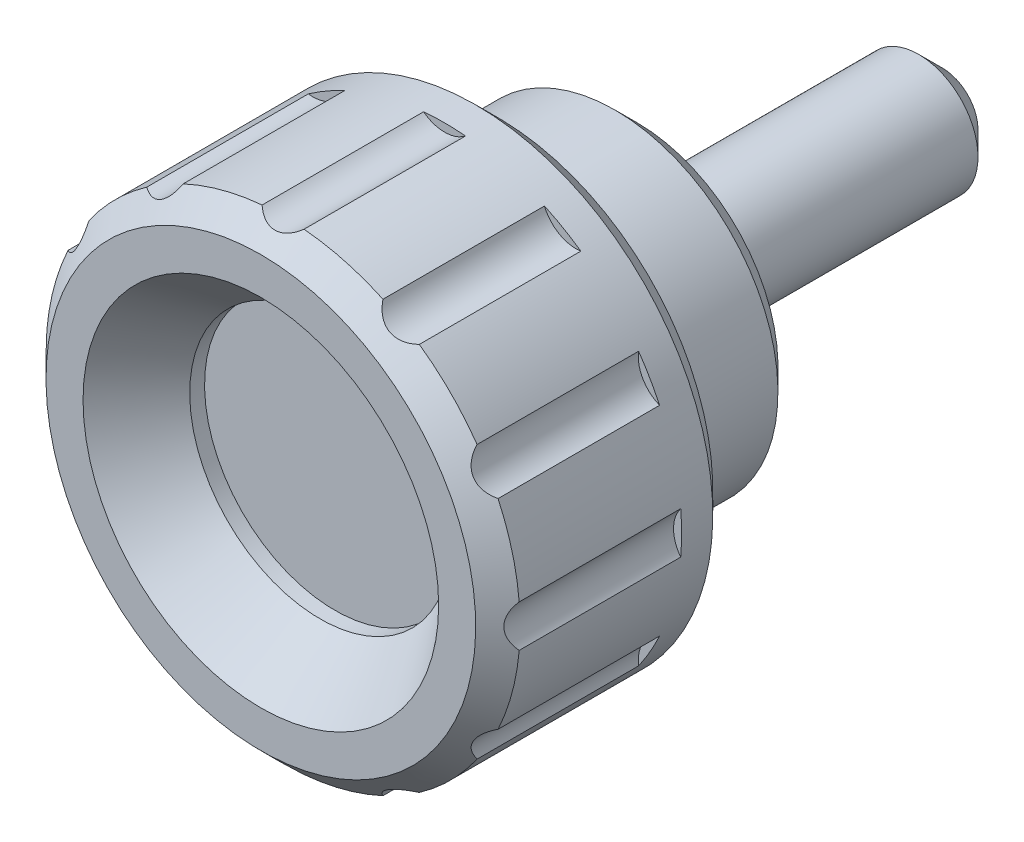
ISO-10303-21;
HEADER;
FILE_DESCRIPTION(('STEP AP214'),'2;1');
FILE_NAME('part.step','',(''),(''),'','','');
FILE_SCHEMA(('AUTOMOTIVE_DESIGN { 1 0 10303 214 1 1 1 1 }'));
ENDSEC;
DATA;
#1=APPLICATION_CONTEXT('core data for automotive mechanical design processes');
#2=APPLICATION_PROTOCOL_DEFINITION('international standard','automotive_design',2000,#1);
#3=PRODUCT_CONTEXT('',#1,'mechanical');
#4=PRODUCT('Part','Part','',(#3));
#5=PRODUCT_RELATED_PRODUCT_CATEGORY('part','',(#4));
#6=PRODUCT_DEFINITION_FORMATION('','',#4);
#7=PRODUCT_DEFINITION_CONTEXT('part definition',#1,'design');
#8=PRODUCT_DEFINITION('design','',#6,#7);
#9=PRODUCT_DEFINITION_SHAPE('','',#8);
#10=(LENGTH_UNIT() NAMED_UNIT(*) SI_UNIT(.MILLI.,.METRE.));
#11=(NAMED_UNIT(*) PLANE_ANGLE_UNIT() SI_UNIT($,.RADIAN.));
#12=(NAMED_UNIT(*) SI_UNIT($,.STERADIAN.) SOLID_ANGLE_UNIT());
#13=UNCERTAINTY_MEASURE_WITH_UNIT(LENGTH_MEASURE(1.E-05),#10,'distance_accuracy_value','');
#14=(GEOMETRIC_REPRESENTATION_CONTEXT(3) GLOBAL_UNCERTAINTY_ASSIGNED_CONTEXT((#13)) GLOBAL_UNIT_ASSIGNED_CONTEXT((#10,
#11,#12)) REPRESENTATION_CONTEXT('',''));
#15=CARTESIAN_POINT('',(0.,0.,0.));
#16=DIRECTION('',(0.,0.,1.));
#17=DIRECTION('',(1.,0.,0.));
#18=AXIS2_PLACEMENT_3D('',#15,#16,#17);
#19=CARTESIAN_POINT('',(3.49999999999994,0.,0.));
#20=DIRECTION('',(0.,0.,-1.));
#21=DIRECTION('',(0.,1.,0.));
#22=AXIS2_PLACEMENT_3D('',#19,#20,#21);
#23=PLANE('',#22);
#24=CARTESIAN_POINT('',(0.,0.,0.));
#25=DIRECTION('',(0.,0.,-1.));
#26=DIRECTION('',(-1.,0.,0.));
#27=AXIS2_PLACEMENT_3D('',#24,#25,#26);
#28=CIRCLE('',#27,3.);
#29=CARTESIAN_POINT('',(-3.,0.,0.));
#30=VERTEX_POINT('',#29);
#31=EDGE_CURVE('E195',#30,#30,#28,.F.);
#32=ORIENTED_EDGE('',*,*,#31,.F.);
#33=EDGE_LOOP('',(#32));
#34=FACE_BOUND('',#33,.T.);
#35=CARTESIAN_POINT('',(0.,0.,0.));
#36=DIRECTION('',(0.,0.,-1.));
#37=DIRECTION('',(-1.,0.,0.));
#38=AXIS2_PLACEMENT_3D('',#35,#36,#37);
#39=CIRCLE('',#38,2.);
#40=CARTESIAN_POINT('',(-2.,0.,0.));
#41=VERTEX_POINT('',#40);
#42=EDGE_CURVE('E462',#41,#41,#39,.T.);
#43=ORIENTED_EDGE('',*,*,#42,.F.);
#44=EDGE_LOOP('',(#43));
#45=FACE_BOUND('',#44,.T.);
#46=ADVANCED_FACE('F14',(#34,#45),#23,.T.);
#47=CARTESIAN_POINT('',(4.74999999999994,0.,0.300000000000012));
#48=DIRECTION('',(0.,0.,-1.));
#49=DIRECTION('',(0.,1.,0.));
#50=AXIS2_PLACEMENT_3D('',#47,#48,#49);
#51=PLANE('',#50);
#52=CARTESIAN_POINT('',(0.,0.,0.300000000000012));
#53=DIRECTION('',(0.,0.,-1.));
#54=DIRECTION('',(0.,1.,0.));
#55=AXIS2_PLACEMENT_3D('',#52,#53,#54);
#56=CIRCLE('',#55,4.74999999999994);
#57=CARTESIAN_POINT('',(0.,4.74999999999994,0.300000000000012));
#58=VERTEX_POINT('',#57);
#59=EDGE_CURVE('E348',#58,#58,#56,.T.);
#60=ORIENTED_EDGE('',*,*,#59,.T.);
#61=EDGE_LOOP('',(#60));
#62=FACE_BOUND('',#61,.T.);
#63=CARTESIAN_POINT('',(0.,0.,0.300000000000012));
#64=DIRECTION('',(0.,0.,-1.));
#65=DIRECTION('',(-1.,0.,0.));
#66=AXIS2_PLACEMENT_3D('',#63,#64,#65);
#67=CIRCLE('',#66,3.);
#68=CARTESIAN_POINT('',(-3.,0.,0.300000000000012));
#69=VERTEX_POINT('',#68);
#70=EDGE_CURVE('E442',#69,#69,#67,.T.);
#71=ORIENTED_EDGE('',*,*,#70,.F.);
#72=EDGE_LOOP('',(#71));
#73=FACE_BOUND('',#72,.T.);
#74=ADVANCED_FACE('F400',(#62,#73),#51,.T.);
#75=CARTESIAN_POINT('',(0.,0.,0.300000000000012));
#76=DIRECTION('',(0.,0.,1.));
#77=DIRECTION('',(0.,-1.,0.));
#78=AXIS2_PLACEMENT_3D('',#75,#76,#77);
#79=CONICAL_SURFACE('',#78,4.74999999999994,0.785398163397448);
#80=CARTESIAN_POINT('',(0.,0.,1.05000000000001));
#81=DIRECTION('',(0.,0.,-1.));
#82=DIRECTION('',(0.,1.,0.));
#83=AXIS2_PLACEMENT_3D('',#80,#81,#82);
#84=CIRCLE('',#83,5.49999999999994);
#85=CARTESIAN_POINT('',(0.,5.49999999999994,1.05000000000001));
#86=VERTEX_POINT('',#85);
#87=EDGE_CURVE('E344',#86,#86,#84,.T.);
#88=ORIENTED_EDGE('',*,*,#87,.T.);
#89=EDGE_LOOP('',(#88));
#90=FACE_BOUND('',#89,.T.);
#91=ORIENTED_EDGE('',*,*,#59,.F.);
#92=EDGE_LOOP('',(#91));
#93=FACE_BOUND('',#92,.T.);
#94=ADVANCED_FACE('F407',(#90,#93),#79,.T.);
#95=CARTESIAN_POINT('',(0.,0.,0.));
#96=DIRECTION('',(0.,0.,-1.));
#97=DIRECTION('',(0.,1.,0.));
#98=AXIS2_PLACEMENT_3D('',#95,#96,#97);
#99=CYLINDRICAL_SURFACE('',#98,5.49999999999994);
#100=CARTESIAN_POINT('',(0.,0.,5.));
#101=DIRECTION('',(0.,0.,-1.));
#102=DIRECTION('',(-1.,0.,0.));
#103=AXIS2_PLACEMENT_3D('',#100,#101,#102);
#104=CIRCLE('',#103,5.49999999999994);
#105=CARTESIAN_POINT('',(-5.49999999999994,0.,5.));
#106=VERTEX_POINT('',#105);
#107=EDGE_CURVE('E211',#106,#106,#104,.F.);
#108=ORIENTED_EDGE('',*,*,#107,.F.);
#109=EDGE_LOOP('',(#108));
#110=FACE_BOUND('',#109,.T.);
#111=ORIENTED_EDGE('',*,*,#87,.F.);
#112=EDGE_LOOP('',(#111));
#113=FACE_BOUND('',#112,.T.);
#114=ADVANCED_FACE('F475',(#110,#113),#99,.T.);
#115=CARTESIAN_POINT('',(0.,8.,5.));
#116=DIRECTION('',(0.,0.,-1.));
#117=DIRECTION('',(-1.,0.,0.));
#118=AXIS2_PLACEMENT_3D('',#115,#116,#117);
#119=PLANE('',#118);
#120=CARTESIAN_POINT('',(0.,0.,5.));
#121=DIRECTION('',(0.,0.,-1.));
#122=DIRECTION('',(-1.,0.,0.));
#123=AXIS2_PLACEMENT_3D('',#120,#121,#122);
#124=CIRCLE('',#123,7.25);
#125=CARTESIAN_POINT('',(-7.25,0.,5.));
#126=VERTEX_POINT('',#125);
#127=EDGE_CURVE('E216',#126,#126,#124,.T.);
#128=ORIENTED_EDGE('',*,*,#127,.T.);
#129=EDGE_LOOP('',(#128));
#130=FACE_BOUND('',#129,.T.);
#131=ORIENTED_EDGE('',*,*,#107,.T.);
#132=EDGE_LOOP('',(#131));
#133=FACE_BOUND('',#132,.T.);
#134=ADVANCED_FACE('F415',(#130,#133),#119,.T.);
#135=CARTESIAN_POINT('',(4.4,0.,10.5000000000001));
#136=DIRECTION('',(0.,0.,1.));
#137=DIRECTION('',(0.,-1.,0.));
#138=AXIS2_PLACEMENT_3D('',#135,#136,#137);
#139=PLANE('',#138);
#140=CARTESIAN_POINT('',(0.,0.,10.5000000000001));
#141=DIRECTION('',(0.,0.,-1.));
#142=DIRECTION('',(0.,1.,0.));
#143=AXIS2_PLACEMENT_3D('',#140,#141,#142);
#144=CIRCLE('',#143,4.4);
#145=CARTESIAN_POINT('',(0.,4.4,10.5000000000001));
#146=VERTEX_POINT('',#145);
#147=EDGE_CURVE('E288',#146,#146,#144,.T.);
#148=ORIENTED_EDGE('',*,*,#147,.F.);
#149=EDGE_LOOP('',(#148));
#150=FACE_BOUND('',#149,.T.);
#151=ADVANCED_FACE('F388',(#150),#139,.T.);
#152=CARTESIAN_POINT('',(0.,0.,0.));
#153=DIRECTION('',(0.,0.,-1.));
#154=DIRECTION('',(0.,1.,0.));
#155=AXIS2_PLACEMENT_3D('',#152,#153,#154);
#156=CYLINDRICAL_SURFACE('',#155,4.4);
#157=ORIENTED_EDGE('',*,*,#147,.T.);
#158=EDGE_LOOP('',(#157));
#159=FACE_BOUND('',#158,.T.);
#160=CARTESIAN_POINT('',(0.,0.,11.));
#161=DIRECTION('',(0.,0.,-1.));
#162=DIRECTION('',(0.,1.,0.));
#163=AXIS2_PLACEMENT_3D('',#160,#161,#162);
#164=CIRCLE('',#163,4.4);
#165=CARTESIAN_POINT('',(0.,4.4,11.));
#166=VERTEX_POINT('',#165);
#167=EDGE_CURVE('E332',#166,#166,#164,.T.);
#168=ORIENTED_EDGE('',*,*,#167,.F.);
#169=EDGE_LOOP('',(#168));
#170=FACE_BOUND('',#169,.T.);
#171=ADVANCED_FACE('F384',(#159,#170),#156,.F.);
#172=CARTESIAN_POINT('',(0.,0.,13.));
#173=DIRECTION('',(0.,0.,1.));
#174=DIRECTION('',(0.,-1.,0.));
#175=AXIS2_PLACEMENT_3D('',#172,#173,#174);
#176=CONICAL_SURFACE('',#175,6.,0.67474094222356);
#177=ORIENTED_EDGE('',*,*,#167,.T.);
#178=EDGE_LOOP('',(#177));
#179=FACE_BOUND('',#178,.T.);
#180=CARTESIAN_POINT('',(0.,0.,13.));
#181=DIRECTION('',(0.,0.,-1.));
#182=DIRECTION('',(0.,1.,0.));
#183=AXIS2_PLACEMENT_3D('',#180,#181,#182);
#184=CIRCLE('',#183,6.);
#185=CARTESIAN_POINT('',(0.,6.,13.));
#186=VERTEX_POINT('',#185);
#187=EDGE_CURVE('E335',#186,#186,#184,.T.);
#188=ORIENTED_EDGE('',*,*,#187,.F.);
#189=EDGE_LOOP('',(#188));
#190=FACE_BOUND('',#189,.T.);
#191=ADVANCED_FACE('F387',(#179,#190),#176,.F.);
#192=CARTESIAN_POINT('',(6.,0.,13.));
#193=DIRECTION('',(0.,0.,1.));
#194=DIRECTION('',(0.,-1.,0.));
#195=AXIS2_PLACEMENT_3D('',#192,#193,#194);
#196=PLANE('',#195);
#197=ORIENTED_EDGE('',*,*,#187,.T.);
#198=EDGE_LOOP('',(#197));
#199=FACE_BOUND('',#198,.T.);
#200=CARTESIAN_POINT('',(0.,0.,13.));
#201=DIRECTION('',(0.,0.,-1.));
#202=DIRECTION('',(0.,1.,0.));
#203=AXIS2_PLACEMENT_3D('',#200,#201,#202);
#204=CIRCLE('',#203,7.25);
#205=CARTESIAN_POINT('',(0.,7.25,13.));
#206=VERTEX_POINT('',#205);
#207=EDGE_CURVE('E338',#206,#206,#204,.T.);
#208=ORIENTED_EDGE('',*,*,#207,.F.);
#209=EDGE_LOOP('',(#208));
#210=FACE_BOUND('',#209,.T.);
#211=ADVANCED_FACE('F380',(#199,#210),#196,.T.);
#212=CARTESIAN_POINT('',(0.,0.,6.8));
#213=DIRECTION('',(0.,0.,1.));
#214=DIRECTION('',(0.,-1.,0.));
#215=AXIS2_PLACEMENT_3D('',#212,#213,#214);
#216=PLANE('',#215);
#217=CARTESIAN_POINT('',(-1.2490009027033E-13,-8.87500000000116,6.8));
#218=DIRECTION('',(0.,0.,-1.));
#219=DIRECTION('',(0.,-1.,0.));
#220=AXIS2_PLACEMENT_3D('',#217,#218,#219);
#221=CIRCLE('',#220,1.15);
#222=CARTESIAN_POINT('',(-0.707804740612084,-7.96862676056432,6.8));
#223=VERTEX_POINT('',#222);
#224=CARTESIAN_POINT('',(0.70780474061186,-7.96862676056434,6.8));
#225=VERTEX_POINT('',#224);
#226=EDGE_CURVE('E275',#223,#225,#221,.T.);
#227=ORIENTED_EDGE('',*,*,#226,.F.);
#228=CARTESIAN_POINT('',(0.,0.,6.8));
#229=DIRECTION('',(0.,0.,1.));
#230=DIRECTION('',(0.,-1.,0.));
#231=AXIS2_PLACEMENT_3D('',#228,#229,#230);
#232=CIRCLE('',#231,8.);
#233=EDGE_CURVE('E222',#225,#223,#232,.F.);
#234=ORIENTED_EDGE('',*,*,#233,.F.);
#235=EDGE_LOOP('',(#227,#234));
#236=FACE_BOUND('',#235,.T.);
#237=ADVANCED_FACE('F376',(#236),#216,.T.);
#238=CARTESIAN_POINT('',(-1.2490009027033E-13,-8.87500000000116,6.8));
#239=DIRECTION('',(0.,0.,1.));
#240=DIRECTION('',(0.,-1.,0.));
#241=AXIS2_PLACEMENT_3D('',#238,#239,#240);
#242=CYLINDRICAL_SURFACE('',#241,1.15);
#243=DIRECTION('',(0.,0.,1.));
#244=VECTOR('',#243,1.);
#245=CARTESIAN_POINT('',(-0.707804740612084,-7.96862676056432,6.8));
#246=LINE('',#245,#244);
#247=CARTESIAN_POINT('',(-0.707804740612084,-7.96862676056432,12.2499999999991));
#248=VERTEX_POINT('',#247);
#249=EDGE_CURVE('E301',#223,#248,#246,.T.);
#250=ORIENTED_EDGE('',*,*,#249,.F.);
#251=ORIENTED_EDGE('',*,*,#226,.T.);
#252=DIRECTION('',(0.,0.,1.));
#253=VECTOR('',#252,1.);
#254=CARTESIAN_POINT('',(0.70780474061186,-7.96862676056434,6.8));
#255=LINE('',#254,#253);
#256=CARTESIAN_POINT('',(0.707804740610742,-7.96862676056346,12.25));
#257=VERTEX_POINT('',#256);
#258=EDGE_CURVE('E299',#225,#257,#255,.T.);
#259=ORIENTED_EDGE('',*,*,#258,.T.);
#260=CARTESIAN_POINT('',(-0.708004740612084,-7.96878298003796,12.2498266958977));
#261=CARTESIAN_POINT('',(-0.670016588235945,-7.93910304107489,12.2827435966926));
#262=CARTESIAN_POINT('',(-0.629096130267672,-7.91098728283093,12.3141461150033));
#263=CARTESIAN_POINT('',(-0.541113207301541,-7.85895957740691,12.3725489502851));
#264=CARTESIAN_POINT('',(-0.493993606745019,-7.83509230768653,12.3995022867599));
#265=CARTESIAN_POINT('',(-0.403110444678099,-7.79705455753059,12.4426329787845));
#266=CARTESIAN_POINT('',(-0.360275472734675,-7.7819114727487,12.4598771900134));
#267=CARTESIAN_POINT('',(-0.271519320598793,-7.75656520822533,12.4888070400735));
#268=CARTESIAN_POINT('',(-0.225610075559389,-7.74634405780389,12.5005128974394));
#269=CARTESIAN_POINT('',(-0.131281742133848,-7.73151414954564,12.5175147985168));
#270=CARTESIAN_POINT('',(-0.0828445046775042,-7.72695427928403,12.522755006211));
#271=CARTESIAN_POINT('',(0.014487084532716,-7.72406175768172,12.5260777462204));
#272=CARTESIAN_POINT('',(0.0633815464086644,-7.72573064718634,12.5241585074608));
#273=CARTESIAN_POINT('',(0.154026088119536,-7.73456075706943,12.5140225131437));
#274=CARTESIAN_POINT('',(0.195934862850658,-7.74104594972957,12.5065809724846));
#275=CARTESIAN_POINT('',(0.277692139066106,-7.7582480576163,12.4868901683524));
#276=CARTESIAN_POINT('',(0.31753961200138,-7.76896706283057,12.4746385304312));
#277=CARTESIAN_POINT('',(0.408286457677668,-7.79851491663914,12.440973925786));
#278=CARTESIAN_POINT('',(0.458050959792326,-7.8188729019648,12.4178517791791));
#279=CARTESIAN_POINT('',(0.551931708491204,-7.86474498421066,12.3660439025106));
#280=CARTESIAN_POINT('',(0.596041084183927,-7.89026525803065,12.3373515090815));
#281=CARTESIAN_POINT('',(0.661880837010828,-7.93410696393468,12.2883657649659));
#282=CARTESIAN_POINT('',(0.685443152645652,-7.95116148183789,12.2693731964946));
#283=CARTESIAN_POINT('',(0.708004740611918,-7.96878298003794,12.2498266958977));
#284=B_SPLINE_CURVE_WITH_KNOTS('',3,(#260,#261,#262,#263,#264,#265,#266,#267,#268,#269,#270,
#271,#272,#273,#274,#275,#276,#277,#278,#279,#280,#281,#282,#283),.UNSPECIFIED.,.F.,.F.,(4,2,2,
2,2,2,2,2,2,2,2,4),(0.,0.17542065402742,0.352589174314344,0.497789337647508,0.642455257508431,
0.78836193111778,0.934304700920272,1.06290984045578,1.19157854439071,1.36619586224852,
1.54102336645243,1.64509140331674),.UNSPECIFIED.);
#285=EDGE_CURVE('E503',#248,#257,#284,.T.);
#286=ORIENTED_EDGE('',*,*,#285,.F.);
#287=EDGE_LOOP('',(#250,#251,#259,#286));
#288=FACE_BOUND('',#287,.T.);
#289=ADVANCED_FACE('F379',(#288),#242,.F.);
#290=CARTESIAN_POINT('',(4.43750000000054,-7.68597545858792,6.8));
#291=DIRECTION('',(0.,0.,-1.));
#292=DIRECTION('',(0.,-1.,0.));
#293=AXIS2_PLACEMENT_3D('',#290,#291,#292);
#294=CIRCLE('',#293,1.15);
#295=CARTESIAN_POINT('',(3.37133649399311,-7.25493557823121,6.8));
#296=VERTEX_POINT('',#295);
#297=CARTESIAN_POINT('',(4.59729026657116,-6.54713083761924,6.8));
#298=VERTEX_POINT('',#297);
#299=EDGE_CURVE('E278',#296,#298,#294,.T.);
#300=ORIENTED_EDGE('',*,*,#299,.F.);
#301=EDGE_CURVE('E218',#298,#296,#232,.F.);
#302=ORIENTED_EDGE('',*,*,#301,.F.);
#303=EDGE_LOOP('',(#300,#302));
#304=FACE_BOUND('',#303,.T.);
#305=ADVANCED_FACE('F383',(#304),#216,.T.);
#306=CARTESIAN_POINT('',(4.43750000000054,-7.68597545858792,6.8));
#307=DIRECTION('',(0.,0.,1.));
#308=DIRECTION('',(0.,-1.,0.));
#309=AXIS2_PLACEMENT_3D('',#306,#307,#308);
#310=CYLINDRICAL_SURFACE('',#309,1.15);
#311=DIRECTION('',(0.,0.,1.));
#312=VECTOR('',#311,1.);
#313=CARTESIAN_POINT('',(3.37133649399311,-7.25493557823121,6.8));
#314=LINE('',#313,#312);
#315=CARTESIAN_POINT('',(3.37133649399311,-7.25493557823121,12.2499999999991));
#316=VERTEX_POINT('',#315);
#317=EDGE_CURVE('E297',#296,#316,#314,.T.);
#318=ORIENTED_EDGE('',*,*,#317,.F.);
#319=ORIENTED_EDGE('',*,*,#299,.T.);
#320=DIRECTION('',(0.,0.,1.));
#321=VECTOR('',#320,1.);
#322=CARTESIAN_POINT('',(4.59729026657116,-6.54713083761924,6.8));
#323=LINE('',#322,#321);
#324=CARTESIAN_POINT('',(4.59729026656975,-6.54713083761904,12.25));
#325=VERTEX_POINT('',#324);
#326=EDGE_CURVE('E295',#298,#325,#323,.T.);
#327=ORIENTED_EDGE('',*,*,#326,.T.);
#328=CARTESIAN_POINT('',(3.37125565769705,-7.25513557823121,12.2498526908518));
#329=CARTESIAN_POINT('',(3.38931533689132,-7.2104398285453,12.2827673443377));
#330=CARTESIAN_POINT('',(3.41069638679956,-7.16563264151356,12.3141675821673));
#331=CARTESIAN_POINT('',(3.46087905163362,-7.07658806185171,12.3725658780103));
#332=CARTESIAN_POINT('',(3.48975247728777,-7.032360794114,12.399516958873));
#333=CARTESIAN_POINT('',(3.54944136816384,-6.95398075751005,12.4426442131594));
#334=CARTESIAN_POINT('',(3.57896658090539,-6.91945000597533,12.459887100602));
#335=CARTESIAN_POINT('',(3.64315945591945,-6.85312362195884,12.4888142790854));
#336=CARTESIAN_POINT('',(3.67780779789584,-6.82131839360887,12.5005187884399));
#337=CARTESIAN_POINT('',(3.75208390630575,-6.76131362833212,12.5175180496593));
#338=CARTESIAN_POINT('',(3.79175182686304,-6.73314735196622,12.5227569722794));
#339=CARTESIAN_POINT('',(3.87459677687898,-6.68197914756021,12.5260773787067));
#340=CARTESIAN_POINT('',(3.91777467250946,-6.65897849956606,12.5241570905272));
#341=CARTESIAN_POINT('',(4.00068974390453,-6.62130533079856,12.5140193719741));
#342=CARTESIAN_POINT('',(4.04022639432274,-6.60596809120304,12.5065770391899));
#343=CARTESIAN_POINT('',(4.1196311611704,-6.57998847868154,12.4868847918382));
#344=CARTESIAN_POINT('',(4.15949943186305,-6.56934843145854,12.4746325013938));
#345=CARTESIAN_POINT('',(4.25286326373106,-6.54956561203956,12.4409660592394));
#346=CARTESIAN_POINT('',(4.30614049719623,-6.54231471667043,12.4178426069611));
#347=CARTESIAN_POINT('',(4.41038121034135,-6.53510255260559,12.3660321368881));
#348=CARTESIAN_POINT('',(4.46134183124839,-6.53515005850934,12.3373384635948));
#349=CARTESIAN_POINT('',(4.54025639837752,-6.54019818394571,12.2883669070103));
#350=CARTESIAN_POINT('',(4.56916440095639,-6.54318368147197,12.269391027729));
#351=CARTESIAN_POINT('',(4.59749026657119,-6.5471589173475,12.2498620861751));
#352=B_SPLINE_CURVE_WITH_KNOTS('',3,(#328,#329,#330,#331,#332,#333,#334,#335,#336,#337,#338,
#339,#340,#341,#342,#343,#344,#345,#346,#347,#348,#349,#350,#351),.UNSPECIFIED.,.F.,.F.,(4,2,2,
2,2,2,2,2,2,2,2,4),(0.,0.175413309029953,0.352574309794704,0.497771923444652,0.64243531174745,
0.788339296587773,0.934279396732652,1.06288407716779,1.19155236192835,1.36617341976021,
1.54100441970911,1.64498267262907),.UNSPECIFIED.);
#353=EDGE_CURVE('E496',#316,#325,#352,.T.);
#354=ORIENTED_EDGE('',*,*,#353,.F.);
#355=EDGE_LOOP('',(#318,#319,#327,#354));
#356=FACE_BOUND('',#355,.T.);
#357=ADVANCED_FACE('F510',(#356),#310,.F.);
#358=CARTESIAN_POINT('',(7.68597545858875,-4.43749999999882,6.8));
#359=DIRECTION('',(0.,0.,-1.));
#360=DIRECTION('',(0.,-1.,0.));
#361=AXIS2_PLACEMENT_3D('',#358,#359,#360);
#362=CIRCLE('',#361,1.15000000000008);
#363=CARTESIAN_POINT('',(6.54713083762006,-4.59729026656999,6.8));
#364=VERTEX_POINT('',#363);
#365=CARTESIAN_POINT('',(7.25493557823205,-3.37133649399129,6.8));
#366=VERTEX_POINT('',#365);
#367=EDGE_CURVE('E281',#364,#366,#362,.T.);
#368=ORIENTED_EDGE('',*,*,#367,.F.);
#369=EDGE_CURVE('E212',#366,#364,#232,.F.);
#370=ORIENTED_EDGE('',*,*,#369,.F.);
#371=EDGE_LOOP('',(#368,#370));
#372=FACE_BOUND('',#371,.T.);
#373=ADVANCED_FACE('F513',(#372),#216,.T.);
#374=CARTESIAN_POINT('',(7.68597545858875,-4.43749999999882,6.8));
#375=DIRECTION('',(0.,0.,1.));
#376=DIRECTION('',(0.,-1.,0.));
#377=AXIS2_PLACEMENT_3D('',#374,#375,#376);
#378=CYLINDRICAL_SURFACE('',#377,1.15000000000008);
#379=DIRECTION('',(0.,0.,1.));
#380=VECTOR('',#379,1.);
#381=CARTESIAN_POINT('',(6.54713083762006,-4.59729026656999,6.8));
#382=LINE('',#381,#380);
#383=CARTESIAN_POINT('',(6.54713083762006,-4.59729026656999,12.2499999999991));
#384=VERTEX_POINT('',#383);
#385=EDGE_CURVE('E293',#364,#384,#382,.T.);
#386=ORIENTED_EDGE('',*,*,#385,.F.);
#387=ORIENTED_EDGE('',*,*,#367,.T.);
#388=DIRECTION('',(0.,0.,1.));
#389=VECTOR('',#388,1.);
#390=CARTESIAN_POINT('',(7.25493557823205,-3.37133649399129,6.8));
#391=LINE('',#390,#389);
#392=CARTESIAN_POINT('',(7.25493557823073,-3.37133649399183,12.25));
#393=VERTEX_POINT('',#392);
#394=EDGE_CURVE('E291',#366,#393,#391,.T.);
#395=ORIENTED_EDGE('',*,*,#394,.T.);
#396=CARTESIAN_POINT('',(6.54715891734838,-4.59749026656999,12.249862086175));
#397=CARTESIAN_POINT('',(6.54045182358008,-4.54975319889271,12.2827759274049));
#398=CARTESIAN_POINT('',(6.53656536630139,-4.50025899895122,12.3141753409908));
#399=CARTESIAN_POINT('',(6.53550363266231,-4.39805391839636,12.3725719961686));
#400=CARTESIAN_POINT('',(6.53839560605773,-4.34531590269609,12.3995222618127));
#401=CARTESIAN_POINT('',(6.55089846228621,-4.24759324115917,12.4426482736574));
#402=CARTESIAN_POINT('',(6.55920303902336,-4.20292634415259,12.4598906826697));
#403=CARTESIAN_POINT('',(6.58163319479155,-4.11339009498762,12.4888168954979));
#404=CARTESIAN_POINT('',(6.59573724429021,-4.06852209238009,12.5005209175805));
#405=CARTESIAN_POINT('',(6.63006040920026,-3.97941910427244,12.5175192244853));
#406=CARTESIAN_POINT('',(6.65033092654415,-3.93519284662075,12.5227576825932));
#407=CARTESIAN_POINT('',(6.69649299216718,-3.84945829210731,12.5260772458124));
#408=CARTESIAN_POINT('',(6.72238593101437,-3.8079506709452,12.5241565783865));
#409=CARTESIAN_POINT('',(6.77535612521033,-3.73386792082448,12.5140182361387));
#410=CARTESIAN_POINT('',(6.80192739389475,-3.70081740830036,12.5065756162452));
#411=CARTESIAN_POINT('',(6.85770436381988,-3.63861654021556,12.486882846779));
#412=CARTESIAN_POINT('',(6.88691136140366,-3.60946812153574,12.4746303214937));
#413=CARTESIAN_POINT('',(6.95787590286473,-3.54565408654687,12.4409632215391));
#414=CARTESIAN_POINT('',(7.00039031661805,-3.51273611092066,12.4178393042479));
#415=CARTESIAN_POINT('',(7.08706015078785,-3.45437012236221,12.3660279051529));
#416=CARTESIAN_POINT('',(7.13121748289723,-3.42893113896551,12.3373337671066));
#417=CARTESIAN_POINT('',(7.20208570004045,-3.39384524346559,12.2883604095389));
#418=CARTESIAN_POINT('',(7.22861528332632,-3.38197627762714,12.2693831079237));
#419=CARTESIAN_POINT('',(7.25513557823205,-3.37125565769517,12.2498526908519));
#420=B_SPLINE_CURVE_WITH_KNOTS('',3,(#396,#397,#398,#399,#400,#401,#402,#403,#404,#405,#406,
#407,#408,#409,#410,#411,#412,#413,#414,#415,#416,#417,#418,#419),.UNSPECIFIED.,.F.,.F.,(4,2,2,
2,2,2,2,2,2,2,2,4),(0.,0.175410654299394,0.352568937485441,0.497765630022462,0.642428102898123,
0.788331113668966,0.934270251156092,1.06287477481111,1.19154289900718,1.36616525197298,
1.54099757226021,1.64498268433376),.UNSPECIFIED.);
#421=EDGE_CURVE('E207',#384,#393,#420,.T.);
#422=ORIENTED_EDGE('',*,*,#421,.F.);
#423=EDGE_LOOP('',(#386,#387,#395,#422));
#424=FACE_BOUND('',#423,.T.);
#425=ADVANCED_FACE('F482',(#424),#378,.F.);
#426=CARTESIAN_POINT('',(8.87500000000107,1.83793952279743E-12,6.8));
#427=DIRECTION('',(0.,0.,-1.));
#428=DIRECTION('',(0.,-1.,0.));
#429=AXIS2_PLACEMENT_3D('',#426,#427,#428);
#430=CIRCLE('',#429,1.15);
#431=CARTESIAN_POINT('',(7.96862676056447,-0.707804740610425,6.8));
#432=VERTEX_POINT('',#431);
#433=CARTESIAN_POINT('',(7.96862676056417,0.707804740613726,6.8));
#434=VERTEX_POINT('',#433);
#435=EDGE_CURVE('E189',#432,#434,#430,.T.);
#436=ORIENTED_EDGE('',*,*,#435,.F.);
#437=EDGE_CURVE('E203',#434,#432,#232,.F.);
#438=ORIENTED_EDGE('',*,*,#437,.F.);
#439=EDGE_LOOP('',(#436,#438));
#440=FACE_BOUND('',#439,.T.);
#441=ADVANCED_FACE('F480',(#440),#216,.T.);
#442=CARTESIAN_POINT('',(8.87500000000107,1.83793952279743E-12,6.8));
#443=DIRECTION('',(0.,0.,1.));
#444=DIRECTION('',(0.,-1.,0.));
#445=AXIS2_PLACEMENT_3D('',#442,#443,#444);
#446=CYLINDRICAL_SURFACE('',#445,1.15);
#447=DIRECTION('',(0.,0.,1.));
#448=VECTOR('',#447,1.);
#449=CARTESIAN_POINT('',(7.96862676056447,-0.707804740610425,6.8));
#450=LINE('',#449,#448);
#451=CARTESIAN_POINT('',(7.96862676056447,-0.707804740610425,12.2499999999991));
#452=VERTEX_POINT('',#451);
#453=EDGE_CURVE('E289',#432,#452,#450,.T.);
#454=ORIENTED_EDGE('',*,*,#453,.F.);
#455=ORIENTED_EDGE('',*,*,#435,.T.);
#456=DIRECTION('',(0.,0.,1.));
#457=VECTOR('',#456,1.);
#458=CARTESIAN_POINT('',(7.96862676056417,0.707804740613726,6.8));
#459=LINE('',#458,#457);
#460=CARTESIAN_POINT('',(7.9686267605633,0.707804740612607,12.25));
#461=VERTEX_POINT('',#460);
#462=EDGE_CURVE('E286',#434,#461,#459,.T.);
#463=ORIENTED_EDGE('',*,*,#462,.T.);
#464=CARTESIAN_POINT('',(7.9687829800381,-0.708004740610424,12.2498266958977));
#465=CARTESIAN_POINT('',(7.93910304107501,-0.670016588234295,12.2827435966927));
#466=CARTESIAN_POINT('',(7.91098728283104,-0.629096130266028,12.3141461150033));
#467=CARTESIAN_POINT('',(7.85895957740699,-0.541113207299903,12.3725489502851));
#468=CARTESIAN_POINT('',(7.83509230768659,-0.49399360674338,12.3995022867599));
#469=CARTESIAN_POINT('',(7.79705455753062,-0.403110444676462,12.4426329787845));
#470=CARTESIAN_POINT('',(7.78191147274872,-0.36027547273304,12.4598771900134));
#471=CARTESIAN_POINT('',(7.75656520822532,-0.271519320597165,12.4888070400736));
#472=CARTESIAN_POINT('',(7.74634405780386,-0.225610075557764,12.5005128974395));
#473=CARTESIAN_POINT('',(7.73151414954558,-0.131281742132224,12.5175147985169));
#474=CARTESIAN_POINT('',(7.72695427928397,-0.0828445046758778,12.5227550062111));
#475=CARTESIAN_POINT('',(7.72406175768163,0.0144870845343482,12.5260777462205));
#476=CARTESIAN_POINT('',(7.72573064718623,0.0633815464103,12.5241585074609));
#477=CARTESIAN_POINT('',(7.7345607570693,0.154026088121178,12.5140225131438));
#478=CARTESIAN_POINT('',(7.74104594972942,0.195934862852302,12.5065809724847));
#479=CARTESIAN_POINT('',(7.75824805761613,0.277692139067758,12.4868901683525));
#480=CARTESIAN_POINT('',(7.76896706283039,0.317539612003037,12.4746385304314));
#481=CARTESIAN_POINT('',(7.79851491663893,0.408286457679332,12.4409739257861));
#482=CARTESIAN_POINT('',(7.81887290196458,0.458050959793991,12.4178517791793));
#483=CARTESIAN_POINT('',(7.86474498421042,0.551931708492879,12.3660439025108));
#484=CARTESIAN_POINT('',(7.89026525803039,0.596041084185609,12.3373515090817));
#485=CARTESIAN_POINT('',(7.93410696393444,0.661880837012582,12.288365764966));
#486=CARTESIAN_POINT('',(7.95116148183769,0.685443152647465,12.2693731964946));
#487=CARTESIAN_POINT('',(7.96878298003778,0.708004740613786,12.2498266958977));
#488=B_SPLINE_CURVE_WITH_KNOTS('',3,(#464,#465,#466,#467,#468,#469,#470,#471,#472,#473,#474,
#475,#476,#477,#478,#479,#480,#481,#482,#483,#484,#485,#486,#487),.UNSPECIFIED.,.F.,.F.,(4,2,2,
2,2,2,2,2,2,2,2,4),(0.,0.175420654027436,0.352589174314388,0.497789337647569,0.642455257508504,
0.788361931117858,0.934304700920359,1.06290984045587,1.19157854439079,1.36619586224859,
1.5410233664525,1.64509140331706),.UNSPECIFIED.);
#489=EDGE_CURVE('E201',#452,#461,#488,.T.);
#490=ORIENTED_EDGE('',*,*,#489,.F.);
#491=EDGE_LOOP('',(#454,#455,#463,#490));
#492=FACE_BOUND('',#491,.T.);
#493=ADVANCED_FACE('F476',(#492),#446,.F.);
#494=CARTESIAN_POINT('',(7.68597545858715,4.43750000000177,6.8));
#495=DIRECTION('',(0.,0.,-1.));
#496=DIRECTION('',(0.,-1.,0.));
#497=AXIS2_PLACEMENT_3D('',#494,#495,#496);
#498=CIRCLE('',#497,1.15);
#499=CARTESIAN_POINT('',(7.25493557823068,3.37133649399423,6.8));
#500=VERTEX_POINT('',#499);
#501=CARTESIAN_POINT('',(6.54713083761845,4.59729026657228,6.8));
#502=VERTEX_POINT('',#501);
#503=EDGE_CURVE('E180',#500,#502,#498,.T.);
#504=ORIENTED_EDGE('',*,*,#503,.F.);
#505=EDGE_CURVE('E193',#502,#500,#232,.F.);
#506=ORIENTED_EDGE('',*,*,#505,.F.);
#507=EDGE_LOOP('',(#504,#506));
#508=FACE_BOUND('',#507,.T.);
#509=ADVANCED_FACE('F192',(#508),#216,.T.);
#510=CARTESIAN_POINT('',(7.68597545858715,4.43750000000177,6.8));
#511=DIRECTION('',(0.,0.,1.));
#512=DIRECTION('',(0.,-1.,0.));
#513=AXIS2_PLACEMENT_3D('',#510,#511,#512);
#514=CYLINDRICAL_SURFACE('',#513,1.15);
#515=DIRECTION('',(0.,0.,1.));
#516=VECTOR('',#515,1.);
#517=CARTESIAN_POINT('',(7.25493557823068,3.37133649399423,6.8));
#518=LINE('',#517,#516);
#519=CARTESIAN_POINT('',(7.25493557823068,3.37133649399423,12.2499999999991));
#520=VERTEX_POINT('',#519);
#521=EDGE_CURVE('E177',#500,#520,#518,.T.);
#522=ORIENTED_EDGE('',*,*,#521,.F.);
#523=ORIENTED_EDGE('',*,*,#503,.T.);
#524=DIRECTION('',(0.,0.,1.));
#525=VECTOR('',#524,1.);
#526=CARTESIAN_POINT('',(6.54713083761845,4.59729026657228,6.8));
#527=LINE('',#526,#525);
#528=CARTESIAN_POINT('',(6.54713083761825,4.59729026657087,12.25));
#529=VERTEX_POINT('',#528);
#530=EDGE_CURVE('E188',#502,#529,#527,.T.);
#531=ORIENTED_EDGE('',*,*,#530,.T.);
#532=CARTESIAN_POINT('',(7.25513557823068,3.37125565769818,12.2498526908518));
#533=CARTESIAN_POINT('',(7.21043982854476,3.38931533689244,12.2827673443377));
#534=CARTESIAN_POINT('',(7.16563264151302,3.41069638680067,12.3141675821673));
#535=CARTESIAN_POINT('',(7.07658806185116,3.46087905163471,12.3725658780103));
#536=CARTESIAN_POINT('',(7.03236079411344,3.48975247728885,12.399516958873));
#537=CARTESIAN_POINT('',(6.95398075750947,3.5494413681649,12.4426442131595));
#538=CARTESIAN_POINT('',(6.91945000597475,3.57896658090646,12.459887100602));
#539=CARTESIAN_POINT('',(6.85312362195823,3.6431594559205,12.4888142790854));
#540=CARTESIAN_POINT('',(6.82131839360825,3.67780779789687,12.50051878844));
#541=CARTESIAN_POINT('',(6.76131362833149,3.75208390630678,12.5175180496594));
#542=CARTESIAN_POINT('',(6.73314735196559,3.79175182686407,12.5227569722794));
#543=CARTESIAN_POINT('',(6.68197914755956,3.87459677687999,12.5260773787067));
#544=CARTESIAN_POINT('',(6.6589784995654,3.91777467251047,12.5241570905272));
#545=CARTESIAN_POINT('',(6.62130533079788,4.00068974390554,12.5140193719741));
#546=CARTESIAN_POINT('',(6.60596809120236,4.04022639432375,12.50657703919));
#547=CARTESIAN_POINT('',(6.57998847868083,4.1196311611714,12.4868847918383));
#548=CARTESIAN_POINT('',(6.56934843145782,4.15949943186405,12.4746325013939));
#549=CARTESIAN_POINT('',(6.54956561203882,4.25286326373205,12.4409660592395));
#550=CARTESIAN_POINT('',(6.54231471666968,4.30614049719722,12.4178426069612));
#551=CARTESIAN_POINT('',(6.53510255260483,4.41038121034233,12.3660321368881));
#552=CARTESIAN_POINT('',(6.53515005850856,4.46134183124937,12.3373384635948));
#553=CARTESIAN_POINT('',(6.54019818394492,4.54025639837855,12.2883669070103));
#554=CARTESIAN_POINT('',(6.54318368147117,4.56916440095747,12.269391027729));
#555=CARTESIAN_POINT('',(6.54715891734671,4.59749026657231,12.2498620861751));
#556=B_SPLINE_CURVE_WITH_KNOTS('',3,(#532,#533,#534,#535,#536,#537,#538,#539,#540,#541,#542,
#543,#544,#545,#546,#547,#548,#549,#550,#551,#552,#553,#554,#555),.UNSPECIFIED.,.F.,.F.,(4,2,2,
2,2,2,2,2,2,2,2,4),(0.,0.175413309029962,0.352574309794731,0.497771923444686,0.642435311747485,
0.788339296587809,0.934279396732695,1.06288407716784,1.1915523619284,1.36617341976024,
1.54100441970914,1.64498267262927),.UNSPECIFIED.);
#557=EDGE_CURVE('E183',#520,#529,#556,.T.);
#558=ORIENTED_EDGE('',*,*,#557,.F.);
#559=EDGE_LOOP('',(#522,#523,#531,#558));
#560=FACE_BOUND('',#559,.T.);
#561=ADVANCED_FACE('F179',(#560),#514,.F.);
#562=CARTESIAN_POINT('',(4.43750000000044,7.68597545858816,6.8));
#563=DIRECTION('',(0.,0.,-1.));
#564=DIRECTION('',(0.,-1.,0.));
#565=AXIS2_PLACEMENT_3D('',#562,#563,#564);
#566=CIRCLE('',#565,1.15);
#567=CARTESIAN_POINT('',(4.59729026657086,6.54713083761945,6.8));
#568=VERTEX_POINT('',#567);
#569=CARTESIAN_POINT('',(3.3713364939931,7.25493557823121,6.8));
#570=VERTEX_POINT('',#569);
#571=EDGE_CURVE('E194',#568,#570,#566,.T.);
#572=ORIENTED_EDGE('',*,*,#571,.F.);
#573=EDGE_CURVE('E200',#570,#568,#232,.F.);
#574=ORIENTED_EDGE('',*,*,#573,.F.);
#575=EDGE_LOOP('',(#572,#574));
#576=FACE_BOUND('',#575,.T.);
#577=ADVANCED_FACE('F372',(#576),#216,.T.);
#578=CARTESIAN_POINT('',(4.43750000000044,7.68597545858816,6.8));
#579=DIRECTION('',(0.,0.,1.));
#580=DIRECTION('',(0.,-1.,0.));
#581=AXIS2_PLACEMENT_3D('',#578,#579,#580);
#582=CYLINDRICAL_SURFACE('',#581,1.15);
#583=DIRECTION('',(0.,0.,1.));
#584=VECTOR('',#583,1.);
#585=CARTESIAN_POINT('',(4.59729026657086,6.54713083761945,6.8));
#586=LINE('',#585,#584);
#587=CARTESIAN_POINT('',(4.59729026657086,6.54713083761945,12.2499999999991));
#588=VERTEX_POINT('',#587);
#589=EDGE_CURVE('E326',#568,#588,#586,.T.);
#590=ORIENTED_EDGE('',*,*,#589,.F.);
#591=ORIENTED_EDGE('',*,*,#571,.T.);
#592=DIRECTION('',(0.,0.,1.));
#593=VECTOR('',#592,1.);
#594=CARTESIAN_POINT('',(3.3713364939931,7.25493557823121,6.8));
#595=LINE('',#594,#593);
#596=CARTESIAN_POINT('',(3.37133649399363,7.25493557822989,12.25));
#597=VERTEX_POINT('',#596);
#598=EDGE_CURVE('E324',#570,#597,#595,.T.);
#599=ORIENTED_EDGE('',*,*,#598,.T.);
#600=CARTESIAN_POINT('',(4.59749026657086,6.54715891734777,12.249862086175));
#601=CARTESIAN_POINT('',(4.5497531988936,6.5404518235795,12.2827759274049));
#602=CARTESIAN_POINT('',(4.50025899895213,6.53656536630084,12.3141753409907));
#603=CARTESIAN_POINT('',(4.39805391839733,6.53550363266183,12.3725719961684));
#604=CARTESIAN_POINT('',(4.34531590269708,6.53839560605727,12.3995222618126));
#605=CARTESIAN_POINT('',(4.2475932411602,6.5508984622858,12.4426482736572));
#606=CARTESIAN_POINT('',(4.20292634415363,6.55920303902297,12.4598906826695));
#607=CARTESIAN_POINT('',(4.11339009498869,6.5816331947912,12.4888168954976));
#608=CARTESIAN_POINT('',(4.06852209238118,6.59573724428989,12.5005209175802));
#609=CARTESIAN_POINT('',(3.97941910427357,6.63006040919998,12.517519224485));
#610=CARTESIAN_POINT('',(3.9351928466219,6.65033092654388,12.5227576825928));
#611=CARTESIAN_POINT('',(3.84945829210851,6.69649299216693,12.526077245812));
#612=CARTESIAN_POINT('',(3.80795067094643,6.72238593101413,12.5241565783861));
#613=CARTESIAN_POINT('',(3.73386792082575,6.77535612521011,12.5140182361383));
#614=CARTESIAN_POINT('',(3.70081740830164,6.80192739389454,12.5065756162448));
#615=CARTESIAN_POINT('',(3.63861654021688,6.85770436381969,12.4868828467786));
#616=CARTESIAN_POINT('',(3.60946812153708,6.88691136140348,12.4746303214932));
#617=CARTESIAN_POINT('',(3.54565408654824,6.95787590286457,12.4409632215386));
#618=CARTESIAN_POINT('',(3.51273611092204,7.00039031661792,12.4178393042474));
#619=CARTESIAN_POINT('',(3.45437012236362,7.08706015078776,12.3660279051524));
#620=CARTESIAN_POINT('',(3.42893113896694,7.13121748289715,12.3373337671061));
#621=CARTESIAN_POINT('',(3.39384524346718,7.20208570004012,12.2883604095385));
#622=CARTESIAN_POINT('',(3.38197627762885,7.22861528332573,12.2693831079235));
#623=CARTESIAN_POINT('',(3.37125565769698,7.25513557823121,12.2498526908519));
#624=B_SPLINE_CURVE_WITH_KNOTS('',3,(#600,#601,#602,#603,#604,#605,#606,#607,#608,#609,#610,
#611,#612,#613,#614,#615,#616,#617,#618,#619,#620,#621,#622,#623),.UNSPECIFIED.,.F.,.F.,(4,2,2,
2,2,2,2,2,2,2,2,4),(0.,0.175410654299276,0.35256893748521,0.497765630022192,0.642428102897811,
0.788331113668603,0.934270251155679,1.06287477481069,1.19154289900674,1.36616525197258,
1.54099757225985,1.64498268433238),.UNSPECIFIED.);
#625=EDGE_CURVE('E358',#588,#597,#624,.T.);
#626=ORIENTED_EDGE('',*,*,#625,.F.);
#627=EDGE_LOOP('',(#590,#591,#599,#626));
#628=FACE_BOUND('',#627,.T.);
#629=ADVANCED_FACE('F373',(#628),#582,.F.);
#630=CARTESIAN_POINT('',(9.3198018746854E-13,8.8750000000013,6.8));
#631=DIRECTION('',(0.,0.,-1.));
#632=DIRECTION('',(0.,-1.,0.));
#633=AXIS2_PLACEMENT_3D('',#630,#631,#632);
#634=CIRCLE('',#633,1.15);
#635=CARTESIAN_POINT('',(0.707804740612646,7.96862676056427,6.8));
#636=VERTEX_POINT('',#635);
#637=CARTESIAN_POINT('',(-0.707804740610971,7.96862676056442,6.8));
#638=VERTEX_POINT('',#637);
#639=EDGE_CURVE('E255',#636,#638,#634,.T.);
#640=ORIENTED_EDGE('',*,*,#639,.F.);
#641=EDGE_CURVE('E205',#638,#636,#232,.F.);
#642=ORIENTED_EDGE('',*,*,#641,.F.);
#643=EDGE_LOOP('',(#640,#642));
#644=FACE_BOUND('',#643,.T.);
#645=ADVANCED_FACE('F254',(#644),#216,.T.);
#646=CARTESIAN_POINT('',(9.3198018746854E-13,8.8750000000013,6.8));
#647=DIRECTION('',(0.,0.,1.));
#648=DIRECTION('',(0.,-1.,0.));
#649=AXIS2_PLACEMENT_3D('',#646,#647,#648);
#650=CYLINDRICAL_SURFACE('',#649,1.15);
#651=DIRECTION('',(0.,0.,1.));
#652=VECTOR('',#651,1.);
#653=CARTESIAN_POINT('',(0.707804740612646,7.96862676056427,6.8));
#654=LINE('',#653,#652);
#655=CARTESIAN_POINT('',(0.707804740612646,7.96862676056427,12.2499999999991));
#656=VERTEX_POINT('',#655);
#657=EDGE_CURVE('E249',#636,#656,#654,.T.);
#658=ORIENTED_EDGE('',*,*,#657,.F.);
#659=ORIENTED_EDGE('',*,*,#639,.T.);
#660=DIRECTION('',(0.,0.,1.));
#661=VECTOR('',#660,1.);
#662=CARTESIAN_POINT('',(-0.707804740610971,7.96862676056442,6.8));
#663=LINE('',#662,#661);
#664=CARTESIAN_POINT('',(-0.707804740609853,7.96862676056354,12.25));
#665=VERTEX_POINT('',#664);
#666=EDGE_CURVE('E29',#638,#665,#663,.T.);
#667=ORIENTED_EDGE('',*,*,#666,.T.);
#668=CARTESIAN_POINT('',(0.708004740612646,7.96878298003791,12.2498266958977));
#669=CARTESIAN_POINT('',(0.670016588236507,7.93910304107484,12.2827435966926));
#670=CARTESIAN_POINT('',(0.629096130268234,7.9109872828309,12.3141461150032));
#671=CARTESIAN_POINT('',(0.541113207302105,7.85895957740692,12.372548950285));
#672=CARTESIAN_POINT('',(0.493993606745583,7.83509230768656,12.3995022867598));
#673=CARTESIAN_POINT('',(0.403110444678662,7.79705455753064,12.4426329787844));
#674=CARTESIAN_POINT('',(0.360275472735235,7.78191147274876,12.4598771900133));
#675=CARTESIAN_POINT('',(0.271519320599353,7.7565652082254,12.4888070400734));
#676=CARTESIAN_POINT('',(0.225610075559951,7.74634405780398,12.5005128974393));
#677=CARTESIAN_POINT('',(0.131281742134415,7.73151414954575,12.5175147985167));
#678=CARTESIAN_POINT('',(0.0828445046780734,7.72695427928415,12.5227550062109));
#679=CARTESIAN_POINT('',(-0.0144870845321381,7.72406175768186,12.5260777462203));
#680=CARTESIAN_POINT('',(-0.0633815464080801,7.7257306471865,12.5241585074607));
#681=CARTESIAN_POINT('',(-0.154026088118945,7.73456075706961,12.5140225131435));
#682=CARTESIAN_POINT('',(-0.195934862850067,7.74104594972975,12.5065809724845));
#683=CARTESIAN_POINT('',(-0.277692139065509,7.75824805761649,12.4868901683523));
#684=CARTESIAN_POINT('',(-0.317539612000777,7.76896706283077,12.4746385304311));
#685=CARTESIAN_POINT('',(-0.40828645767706,7.79851491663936,12.4409739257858));
#686=CARTESIAN_POINT('',(-0.458050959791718,7.81887290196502,12.4178517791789));
#687=CARTESIAN_POINT('',(-0.551931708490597,7.86474498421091,12.3660439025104));
#688=CARTESIAN_POINT('',(-0.596041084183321,7.89026525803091,12.3373515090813));
#689=CARTESIAN_POINT('',(-0.66188083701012,7.93410696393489,12.2883657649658));
#690=CARTESIAN_POINT('',(-0.685443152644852,7.95116148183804,12.2693731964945));
#691=CARTESIAN_POINT('',(-0.708004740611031,7.96878298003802,12.2498266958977));
#692=B_SPLINE_CURVE_WITH_KNOTS('',3,(#668,#669,#670,#671,#672,#673,#674,#675,#676,#677,#678,
#679,#680,#681,#682,#683,#684,#685,#686,#687,#688,#689,#690,#691),.UNSPECIFIED.,.F.,.F.,(4,2,2,
2,2,2,2,2,2,2,2,4),(0.,0.175420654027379,0.352589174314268,0.497789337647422,0.642455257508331,
0.788361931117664,0.934304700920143,1.06290984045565,1.19157854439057,1.3661958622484,
1.54102336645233,1.64509140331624),.UNSPECIFIED.);
#693=EDGE_CURVE('E576',#656,#665,#692,.T.);
#694=ORIENTED_EDGE('',*,*,#693,.F.);
#695=EDGE_LOOP('',(#658,#659,#667,#694));
#696=FACE_BOUND('',#695,.T.);
#697=ADVANCED_FACE('F256',(#696),#650,.F.);
#698=CARTESIAN_POINT('',(-4.43749999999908,7.6859754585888,6.8));
#699=DIRECTION('',(0.,0.,-1.));
#700=DIRECTION('',(0.,-1.,0.));
#701=AXIS2_PLACEMENT_3D('',#698,#699,#700);
#702=CIRCLE('',#701,1.14999999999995);
#703=CARTESIAN_POINT('',(-3.37133649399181,7.25493557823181,6.8));
#704=VERTEX_POINT('',#703);
#705=CARTESIAN_POINT('',(-4.5972902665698,6.54713083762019,6.8));
#706=VERTEX_POINT('',#705);
#707=EDGE_CURVE('E257',#704,#706,#702,.T.);
#708=ORIENTED_EDGE('',*,*,#707,.F.);
#709=EDGE_CURVE('E241',#706,#704,#232,.F.);
#710=ORIENTED_EDGE('',*,*,#709,.F.);
#711=EDGE_LOOP('',(#708,#710));
#712=FACE_BOUND('',#711,.T.);
#713=ADVANCED_FACE('F569',(#712),#216,.T.);
#714=CARTESIAN_POINT('',(-4.43749999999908,7.6859754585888,6.8));
#715=DIRECTION('',(0.,0.,1.));
#716=DIRECTION('',(0.,-1.,0.));
#717=AXIS2_PLACEMENT_3D('',#714,#715,#716);
#718=CYLINDRICAL_SURFACE('',#717,1.14999999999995);
#719=DIRECTION('',(0.,0.,1.));
#720=VECTOR('',#719,1.);
#721=CARTESIAN_POINT('',(-3.37133649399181,7.25493557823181,6.8));
#722=LINE('',#721,#720);
#723=CARTESIAN_POINT('',(-3.37133649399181,7.25493557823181,12.2499999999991));
#724=VERTEX_POINT('',#723);
#725=EDGE_CURVE('E320',#704,#724,#722,.T.);
#726=ORIENTED_EDGE('',*,*,#725,.F.);
#727=ORIENTED_EDGE('',*,*,#707,.T.);
#728=DIRECTION('',(0.,0.,1.));
#729=VECTOR('',#728,1.);
#730=CARTESIAN_POINT('',(-4.5972902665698,6.54713083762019,6.8));
#731=LINE('',#730,#729);
#732=CARTESIAN_POINT('',(-4.5972902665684,6.54713083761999,12.25));
#733=VERTEX_POINT('',#732);
#734=EDGE_CURVE('E37',#706,#733,#731,.T.);
#735=ORIENTED_EDGE('',*,*,#734,.T.);
#736=CARTESIAN_POINT('',(-3.37125565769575,7.25513557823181,12.2498526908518));
#737=CARTESIAN_POINT('',(-3.38931533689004,7.21043982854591,12.2827673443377));
#738=CARTESIAN_POINT('',(-3.41069638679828,7.16563264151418,12.3141675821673));
#739=CARTESIAN_POINT('',(-3.46087905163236,7.07658806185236,12.3725658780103));
#740=CARTESIAN_POINT('',(-3.48975247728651,7.03236079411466,12.3995169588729));
#741=CARTESIAN_POINT('',(-3.54944136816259,6.95398075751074,12.4426442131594));
#742=CARTESIAN_POINT('',(-3.57896658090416,6.91945000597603,12.4598871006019));
#743=CARTESIAN_POINT('',(-3.64315945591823,6.85312362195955,12.4888142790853));
#744=CARTESIAN_POINT('',(-3.67780779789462,6.8213183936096,12.5005187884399));
#745=CARTESIAN_POINT('',(-3.75208390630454,6.76131362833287,12.5175180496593));
#746=CARTESIAN_POINT('',(-3.79175182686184,6.73314735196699,12.5227569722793));
#747=CARTESIAN_POINT('',(-3.87459677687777,6.68197914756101,12.5260773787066));
#748=CARTESIAN_POINT('',(-3.91777467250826,6.65897849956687,12.5241570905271));
#749=CARTESIAN_POINT('',(-4.00068974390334,6.62130533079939,12.514019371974));
#750=CARTESIAN_POINT('',(-4.04022639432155,6.60596809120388,12.5065770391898));
#751=CARTESIAN_POINT('',(-4.11963116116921,6.57998847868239,12.4868847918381));
#752=CARTESIAN_POINT('',(-4.15949943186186,6.5693484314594,12.4746325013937));
#753=CARTESIAN_POINT('',(-4.25286326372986,6.54956561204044,12.4409660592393));
#754=CARTESIAN_POINT('',(-4.30614049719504,6.54231471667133,12.417842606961));
#755=CARTESIAN_POINT('',(-4.41038121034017,6.53510255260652,12.3660321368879));
#756=CARTESIAN_POINT('',(-4.4613418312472,6.53515005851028,12.3373384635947));
#757=CARTESIAN_POINT('',(-4.54025639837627,6.54019818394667,12.2883669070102));
#758=CARTESIAN_POINT('',(-4.56916440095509,6.54318368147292,12.269391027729));
#759=CARTESIAN_POINT('',(-4.59749026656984,6.54715891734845,12.2498620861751));
#760=B_SPLINE_CURVE_WITH_KNOTS('',3,(#736,#737,#738,#739,#740,#741,#742,#743,#744,#745,#746,
#747,#748,#749,#750,#751,#752,#753,#754,#755,#756,#757,#758,#759),.UNSPECIFIED.,.F.,.F.,(4,2,2,
2,2,2,2,2,2,2,2,4),(0.,0.175413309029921,0.352574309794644,0.497771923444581,0.642435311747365,
0.788339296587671,0.934279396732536,1.06288407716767,1.19155236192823,1.36617341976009,
1.54100441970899,1.64498267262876),.UNSPECIFIED.);
#761=EDGE_CURVE('E571',#724,#733,#760,.T.);
#762=ORIENTED_EDGE('',*,*,#761,.F.);
#763=EDGE_LOOP('',(#726,#727,#735,#762));
#764=FACE_BOUND('',#763,.T.);
#765=ADVANCED_FACE('F566',(#764),#718,.F.);
#766=CARTESIAN_POINT('',(-7.68597545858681,4.4375000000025,6.8));
#767=DIRECTION('',(0.,0.,-1.));
#768=DIRECTION('',(0.,-1.,0.));
#769=AXIS2_PLACEMENT_3D('',#766,#767,#768);
#770=CIRCLE('',#769,1.15);
#771=CARTESIAN_POINT('',(-6.54713083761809,4.59729026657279,6.8));
#772=VERTEX_POINT('',#771);
#773=CARTESIAN_POINT('',(-7.25493557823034,3.37133649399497,6.8));
#774=VERTEX_POINT('',#773);
#775=EDGE_CURVE('E259',#772,#774,#770,.T.);
#776=ORIENTED_EDGE('',*,*,#775,.F.);
#777=EDGE_CURVE('E237',#774,#772,#232,.F.);
#778=ORIENTED_EDGE('',*,*,#777,.F.);
#779=EDGE_LOOP('',(#776,#778));
#780=FACE_BOUND('',#779,.T.);
#781=ADVANCED_FACE('F564',(#780),#216,.T.);
#782=CARTESIAN_POINT('',(-7.68597545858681,4.4375000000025,6.8));
#783=DIRECTION('',(0.,0.,1.));
#784=DIRECTION('',(0.,-1.,0.));
#785=AXIS2_PLACEMENT_3D('',#782,#783,#784);
#786=CYLINDRICAL_SURFACE('',#785,1.15);
#787=DIRECTION('',(0.,0.,1.));
#788=VECTOR('',#787,1.);
#789=CARTESIAN_POINT('',(-6.54713083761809,4.59729026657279,6.8));
#790=LINE('',#789,#788);
#791=CARTESIAN_POINT('',(-6.54713083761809,4.59729026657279,12.2499999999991));
#792=VERTEX_POINT('',#791);
#793=EDGE_CURVE('E317',#772,#792,#790,.T.);
#794=ORIENTED_EDGE('',*,*,#793,.F.);
#795=ORIENTED_EDGE('',*,*,#775,.T.);
#796=DIRECTION('',(0.,0.,1.));
#797=VECTOR('',#796,1.);
#798=CARTESIAN_POINT('',(-7.25493557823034,3.37133649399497,6.8));
#799=LINE('',#798,#797);
#800=CARTESIAN_POINT('',(-7.25493557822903,3.3713364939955,12.25));
#801=VERTEX_POINT('',#800);
#802=EDGE_CURVE('E315',#774,#801,#799,.T.);
#803=ORIENTED_EDGE('',*,*,#802,.T.);
#804=CARTESIAN_POINT('',(-6.54715891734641,4.59749026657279,12.249862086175));
#805=CARTESIAN_POINT('',(-6.54045182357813,4.54975319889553,12.2827759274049));
#806=CARTESIAN_POINT('',(-6.53656536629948,4.50025899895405,12.3141753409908));
#807=CARTESIAN_POINT('',(-6.53550363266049,4.39805391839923,12.3725719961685));
#808=CARTESIAN_POINT('',(-6.53839560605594,4.34531590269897,12.3995222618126));
#809=CARTESIAN_POINT('',(-6.55089846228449,4.24759324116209,12.4426482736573));
#810=CARTESIAN_POINT('',(-6.55920303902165,4.20292634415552,12.4598906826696));
#811=CARTESIAN_POINT('',(-6.5816331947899,4.11339009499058,12.4888168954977));
#812=CARTESIAN_POINT('',(-6.5957372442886,4.06852209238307,12.5005209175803));
#813=CARTESIAN_POINT('',(-6.6300604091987,3.97941910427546,12.5175192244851));
#814=CARTESIAN_POINT('',(-6.65033092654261,3.93519284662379,12.522757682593));
#815=CARTESIAN_POINT('',(-6.69649299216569,3.84945829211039,12.5260772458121));
#816=CARTESIAN_POINT('',(-6.7223859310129,3.80795067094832,12.5241565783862));
#817=CARTESIAN_POINT('',(-6.7753561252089,3.73386792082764,12.5140182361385));
#818=CARTESIAN_POINT('',(-6.80192739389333,3.70081740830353,12.506575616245));
#819=CARTESIAN_POINT('',(-6.85770436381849,3.63861654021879,12.4868828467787));
#820=CARTESIAN_POINT('',(-6.88691136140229,3.60946812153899,12.4746303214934));
#821=CARTESIAN_POINT('',(-6.95787590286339,3.54565408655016,12.4409632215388));
#822=CARTESIAN_POINT('',(-7.00039031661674,3.51273611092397,12.4178393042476));
#823=CARTESIAN_POINT('',(-7.08706015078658,3.45437012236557,12.3660279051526));
#824=CARTESIAN_POINT('',(-7.13121748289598,3.4289311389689,12.3373337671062));
#825=CARTESIAN_POINT('',(-7.20208570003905,3.39384524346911,12.2883604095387));
#826=CARTESIAN_POINT('',(-7.22861528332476,3.38197627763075,12.2693831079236));
#827=CARTESIAN_POINT('',(-7.25513557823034,3.37125565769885,12.2498526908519));
#828=B_SPLINE_CURVE_WITH_KNOTS('',3,(#804,#805,#806,#807,#808,#809,#810,#811,#812,#813,#814,
#815,#816,#817,#818,#819,#820,#821,#822,#823,#824,#825,#826,#827),.UNSPECIFIED.,.F.,.F.,(4,2,2,
2,2,2,2,2,2,2,2,4),(0.,0.17541065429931,0.352568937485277,0.497765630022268,0.642428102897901,
0.788331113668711,0.934270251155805,1.06287477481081,1.19154289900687,1.36616525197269,
1.54099757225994,1.64498268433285),.UNSPECIFIED.);
#829=EDGE_CURVE('E547',#792,#801,#828,.T.);
#830=ORIENTED_EDGE('',*,*,#829,.F.);
#831=EDGE_LOOP('',(#794,#795,#803,#830));
#832=FACE_BOUND('',#831,.T.);
#833=ADVANCED_FACE('F560',(#832),#786,.F.);
#834=CARTESIAN_POINT('',(-8.8750000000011,2.03049382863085E-12,6.8));
#835=DIRECTION('',(0.,0.,-1.));
#836=DIRECTION('',(0.,-1.,0.));
#837=AXIS2_PLACEMENT_3D('',#834,#835,#836);
#838=CIRCLE('',#837,1.15);
#839=CARTESIAN_POINT('',(-7.96862676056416,0.707804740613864,6.8));
#840=VERTEX_POINT('',#839);
#841=CARTESIAN_POINT('',(-7.96862676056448,-0.707804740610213,6.8));
#842=VERTEX_POINT('',#841);
#843=EDGE_CURVE('E266',#840,#842,#838,.T.);
#844=ORIENTED_EDGE('',*,*,#843,.F.);
#845=EDGE_CURVE('E233',#842,#840,#232,.F.);
#846=ORIENTED_EDGE('',*,*,#845,.F.);
#847=EDGE_LOOP('',(#844,#846));
#848=FACE_BOUND('',#847,.T.);
#849=ADVANCED_FACE('F558',(#848),#216,.T.);
#850=CARTESIAN_POINT('',(-8.8750000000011,2.03049382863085E-12,6.8));
#851=DIRECTION('',(0.,0.,1.));
#852=DIRECTION('',(0.,-1.,0.));
#853=AXIS2_PLACEMENT_3D('',#850,#851,#852);
#854=CYLINDRICAL_SURFACE('',#853,1.15);
#855=DIRECTION('',(0.,0.,1.));
#856=VECTOR('',#855,1.);
#857=CARTESIAN_POINT('',(-7.96862676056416,0.707804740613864,6.8));
#858=LINE('',#857,#856);
#859=CARTESIAN_POINT('',(-7.96862676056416,0.707804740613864,12.2499999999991));
#860=VERTEX_POINT('',#859);
#861=EDGE_CURVE('E313',#840,#860,#858,.T.);
#862=ORIENTED_EDGE('',*,*,#861,.F.);
#863=ORIENTED_EDGE('',*,*,#843,.T.);
#864=DIRECTION('',(0.,0.,1.));
#865=VECTOR('',#864,1.);
#866=CARTESIAN_POINT('',(-7.96862676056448,-0.707804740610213,6.8));
#867=LINE('',#866,#865);
#868=CARTESIAN_POINT('',(-7.96862676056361,-0.707804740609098,12.25));
#869=VERTEX_POINT('',#868);
#870=EDGE_CURVE('E311',#842,#869,#867,.T.);
#871=ORIENTED_EDGE('',*,*,#870,.T.);
#872=CARTESIAN_POINT('',(-7.9687829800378,0.708004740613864,12.2498266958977));
#873=CARTESIAN_POINT('',(-7.93910304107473,0.670016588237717,12.2827435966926));
#874=CARTESIAN_POINT('',(-7.91098728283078,0.629096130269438,12.3141461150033));
#875=CARTESIAN_POINT('',(-7.85895957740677,0.541113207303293,12.3725489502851));
#876=CARTESIAN_POINT('',(-7.83509230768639,0.493993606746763,12.3995022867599));
#877=CARTESIAN_POINT('',(-7.79705455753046,0.403110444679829,12.4426329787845));
#878=CARTESIAN_POINT('',(-7.78191147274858,0.360275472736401,12.4598771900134));
#879=CARTESIAN_POINT('',(-7.75656520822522,0.271519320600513,12.4888070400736));
#880=CARTESIAN_POINT('',(-7.74634405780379,0.225610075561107,12.5005128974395));
#881=CARTESIAN_POINT('',(-7.73151414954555,0.131281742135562,12.5175147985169));
#882=CARTESIAN_POINT('',(-7.72695427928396,0.0828445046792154,12.5227550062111));
#883=CARTESIAN_POINT('',(-7.72406175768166,-0.0144870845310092,12.5260777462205));
#884=CARTESIAN_POINT('',(-7.72573064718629,-0.0633815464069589,12.5241585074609));
#885=CARTESIAN_POINT('',(-7.7345607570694,-0.154026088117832,12.5140225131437));
#886=CARTESIAN_POINT('',(-7.74104594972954,-0.195934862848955,12.5065809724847));
#887=CARTESIAN_POINT('',(-7.75824805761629,-0.277692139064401,12.4868901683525));
#888=CARTESIAN_POINT('',(-7.76896706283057,-0.317539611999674,12.4746385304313));
#889=CARTESIAN_POINT('',(-7.79851491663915,-0.408286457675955,12.4409739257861));
#890=CARTESIAN_POINT('',(-7.81887290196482,-0.458050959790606,12.4178517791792));
#891=CARTESIAN_POINT('',(-7.8647449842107,-0.551931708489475,12.3660439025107));
#892=CARTESIAN_POINT('',(-7.89026525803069,-0.596041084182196,12.3373515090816));
#893=CARTESIAN_POINT('',(-7.93410696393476,-0.661880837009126,12.288365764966));
#894=CARTESIAN_POINT('',(-7.951161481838,-0.685443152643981,12.2693731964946));
#895=CARTESIAN_POINT('',(-7.96878298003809,-0.708004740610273,12.2498266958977));
#896=B_SPLINE_CURVE_WITH_KNOTS('',3,(#872,#873,#874,#875,#876,#877,#878,#879,#880,#881,#882,
#883,#884,#885,#886,#887,#888,#889,#890,#891,#892,#893,#894,#895),.UNSPECIFIED.,.F.,.F.,(4,2,2,
2,2,2,2,2,2,2,2,4),(0.,0.175420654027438,0.352589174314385,0.497789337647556,0.642455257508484,
0.788361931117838,0.934304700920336,1.06290984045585,1.19157854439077,1.36619586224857,
1.54102336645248,1.64509140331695),.UNSPECIFIED.);
#897=EDGE_CURVE('E540',#860,#869,#896,.T.);
#898=ORIENTED_EDGE('',*,*,#897,.F.);
#899=EDGE_LOOP('',(#862,#863,#871,#898));
#900=FACE_BOUND('',#899,.T.);
#901=ADVANCED_FACE('F554',(#900),#854,.F.);
#902=CARTESIAN_POINT('',(-7.68597545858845,-4.43749999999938,6.8));
#903=DIRECTION('',(0.,0.,-1.));
#904=DIRECTION('',(0.,-1.,0.));
#905=AXIS2_PLACEMENT_3D('',#902,#903,#904);
#906=CIRCLE('',#905,1.15);
#907=CARTESIAN_POINT('',(-7.25493557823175,-3.37133649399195,6.8));
#908=VERTEX_POINT('',#907);
#909=CARTESIAN_POINT('',(-6.54713083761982,-4.59729026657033,6.8));
#910=VERTEX_POINT('',#909);
#911=EDGE_CURVE('E269',#908,#910,#906,.T.);
#912=ORIENTED_EDGE('',*,*,#911,.F.);
#913=EDGE_CURVE('E230',#910,#908,#232,.F.);
#914=ORIENTED_EDGE('',*,*,#913,.F.);
#915=EDGE_LOOP('',(#912,#914));
#916=FACE_BOUND('',#915,.T.);
#917=ADVANCED_FACE('F557',(#916),#216,.T.);
#918=CARTESIAN_POINT('',(-7.68597545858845,-4.43749999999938,6.8));
#919=DIRECTION('',(0.,0.,1.));
#920=DIRECTION('',(0.,-1.,0.));
#921=AXIS2_PLACEMENT_3D('',#918,#919,#920);
#922=CYLINDRICAL_SURFACE('',#921,1.15);
#923=DIRECTION('',(0.,0.,1.));
#924=VECTOR('',#923,1.);
#925=CARTESIAN_POINT('',(-7.25493557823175,-3.37133649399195,6.8));
#926=LINE('',#925,#924);
#927=CARTESIAN_POINT('',(-7.25493557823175,-3.37133649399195,12.2499999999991));
#928=VERTEX_POINT('',#927);
#929=EDGE_CURVE('E309',#908,#928,#926,.T.);
#930=ORIENTED_EDGE('',*,*,#929,.F.);
#931=ORIENTED_EDGE('',*,*,#911,.T.);
#932=DIRECTION('',(0.,0.,1.));
#933=VECTOR('',#932,1.);
#934=CARTESIAN_POINT('',(-6.54713083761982,-4.59729026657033,6.8));
#935=LINE('',#934,#933);
#936=CARTESIAN_POINT('',(-6.54713083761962,-4.59729026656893,12.25));
#937=VERTEX_POINT('',#936);
#938=EDGE_CURVE('E307',#910,#937,#935,.T.);
#939=ORIENTED_EDGE('',*,*,#938,.T.);
#940=CARTESIAN_POINT('',(-7.25513557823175,-3.37125565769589,12.2498526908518));
#941=CARTESIAN_POINT('',(-7.21043982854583,-3.38931533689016,12.2827673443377));
#942=CARTESIAN_POINT('',(-7.16563264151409,-3.4106963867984,12.3141675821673));
#943=CARTESIAN_POINT('',(-7.07658806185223,-3.46087905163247,12.3725658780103));
#944=CARTESIAN_POINT('',(-7.03236079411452,-3.48975247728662,12.399516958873));
#945=CARTESIAN_POINT('',(-6.95398075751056,-3.5494413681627,12.4426442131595));
#946=CARTESIAN_POINT('',(-6.91945000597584,-3.57896658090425,12.4598871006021));
#947=CARTESIAN_POINT('',(-6.85312362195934,-3.64315945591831,12.4888142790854));
#948=CARTESIAN_POINT('',(-6.82131839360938,-3.6778077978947,12.50051878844));
#949=CARTESIAN_POINT('',(-6.76131362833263,-3.75208390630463,12.5175180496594));
#950=CARTESIAN_POINT('',(-6.73314735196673,-3.79175182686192,12.5227569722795));
#951=CARTESIAN_POINT('',(-6.68197914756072,-3.87459677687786,12.5260773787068));
#952=CARTESIAN_POINT('',(-6.65897849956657,-3.91777467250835,12.5241570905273));
#953=CARTESIAN_POINT('',(-6.62130533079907,-4.00068974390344,12.5140193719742));
#954=CARTESIAN_POINT('',(-6.60596809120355,-4.04022639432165,12.5065770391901));
#955=CARTESIAN_POINT('',(-6.57998847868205,-4.11963116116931,12.4868847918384));
#956=CARTESIAN_POINT('',(-6.56934843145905,-4.15949943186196,12.474632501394));
#957=CARTESIAN_POINT('',(-6.54956561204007,-4.25286326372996,12.4409660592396));
#958=CARTESIAN_POINT('',(-6.54231471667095,-4.30614049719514,12.4178426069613));
#959=CARTESIAN_POINT('',(-6.53510255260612,-4.41038121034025,12.3660321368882));
#960=CARTESIAN_POINT('',(-6.53515005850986,-4.46134183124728,12.3373384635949));
#961=CARTESIAN_POINT('',(-6.54019818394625,-4.5402563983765,12.2883669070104));
#962=CARTESIAN_POINT('',(-6.54318368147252,-4.56916440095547,12.2693910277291));
#963=CARTESIAN_POINT('',(-6.54715891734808,-4.59749026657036,12.2498620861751));
#964=B_SPLINE_CURVE_WITH_KNOTS('',3,(#940,#941,#942,#943,#944,#945,#946,#947,#948,#949,#950,
#951,#952,#953,#954,#955,#956,#957,#958,#959,#960,#961,#962,#963),.UNSPECIFIED.,.F.,.F.,(4,2,2,
2,2,2,2,2,2,2,2,4),(0.,0.175413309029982,0.352574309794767,0.497771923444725,0.642435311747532,
0.788339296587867,0.934279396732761,1.0628840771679,1.19155236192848,1.36617341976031,
1.54100441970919,1.64498267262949),.UNSPECIFIED.);
#965=EDGE_CURVE('E533',#928,#937,#964,.T.);
#966=ORIENTED_EDGE('',*,*,#965,.F.);
#967=EDGE_LOOP('',(#930,#931,#939,#966));
#968=FACE_BOUND('',#967,.T.);
#969=ADVANCED_FACE('F523',(#968),#922,.F.);
#970=CARTESIAN_POINT('',(0.,0.,12.25));
#971=DIRECTION('',(0.,0.,-1.));
#972=DIRECTION('',(0.,1.,0.));
#973=AXIS2_PLACEMENT_3D('',#970,#971,#972);
#974=CONICAL_SURFACE('',#973,8.,0.785398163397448);
#975=ORIENTED_EDGE('',*,*,#207,.T.);
#976=EDGE_LOOP('',(#975));
#977=FACE_BOUND('',#976,.T.);
#978=CARTESIAN_POINT('',(0.,0.,12.25));
#979=DIRECTION('',(0.,0.,-1.));
#980=DIRECTION('',(0.,1.,0.));
#981=AXIS2_PLACEMENT_3D('',#978,#979,#980);
#982=CIRCLE('',#981,8.);
#983=EDGE_CURVE('E657',#452,#393,#982,.T.);
#984=ORIENTED_EDGE('',*,*,#983,.F.);
#985=ORIENTED_EDGE('',*,*,#489,.T.);
#986=EDGE_CURVE('E660',#520,#461,#982,.T.);
#987=ORIENTED_EDGE('',*,*,#986,.F.);
#988=ORIENTED_EDGE('',*,*,#557,.T.);
#989=EDGE_CURVE('E345',#588,#529,#982,.T.);
#990=ORIENTED_EDGE('',*,*,#989,.F.);
#991=ORIENTED_EDGE('',*,*,#625,.T.);
#992=EDGE_CURVE('E342',#656,#597,#982,.T.);
#993=ORIENTED_EDGE('',*,*,#992,.F.);
#994=ORIENTED_EDGE('',*,*,#693,.T.);
#995=EDGE_CURVE('E341',#724,#665,#982,.T.);
#996=ORIENTED_EDGE('',*,*,#995,.F.);
#997=ORIENTED_EDGE('',*,*,#761,.T.);
#998=EDGE_CURVE('E650',#792,#733,#982,.T.);
#999=ORIENTED_EDGE('',*,*,#998,.F.);
#1000=ORIENTED_EDGE('',*,*,#829,.T.);
#1001=EDGE_CURVE('E647',#860,#801,#982,.T.);
#1002=ORIENTED_EDGE('',*,*,#1001,.F.);
#1003=ORIENTED_EDGE('',*,*,#897,.T.);
#1004=EDGE_CURVE('E644',#928,#869,#982,.T.);
#1005=ORIENTED_EDGE('',*,*,#1004,.F.);
#1006=ORIENTED_EDGE('',*,*,#965,.T.);
#1007=CARTESIAN_POINT('',(-4.59729026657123,-6.54713083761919,12.2499999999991));
#1008=VERTEX_POINT('',#1007);
#1009=EDGE_CURVE('E640',#1008,#937,#982,.T.);
#1010=ORIENTED_EDGE('',*,*,#1009,.F.);
#1011=CARTESIAN_POINT('',(-4.59749026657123,-6.5471589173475,12.249862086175));
#1012=CARTESIAN_POINT('',(-4.54975319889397,-6.54045182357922,12.2827759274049));
#1013=CARTESIAN_POINT('',(-4.50025899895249,-6.53656536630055,12.3141753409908));
#1014=CARTESIAN_POINT('',(-4.39805391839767,-6.53550363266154,12.3725719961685));
#1015=CARTESIAN_POINT('',(-4.34531590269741,-6.53839560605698,12.3995222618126));
#1016=CARTESIAN_POINT('',(-4.24759324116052,-6.5508984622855,12.4426482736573));
#1017=CARTESIAN_POINT('',(-4.20292634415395,-6.55920303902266,12.4598906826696));
#1018=CARTESIAN_POINT('',(-4.113390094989,-6.58163319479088,12.4888168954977));
#1019=CARTESIAN_POINT('',(-4.06852209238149,-6.59573724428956,12.5005209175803));
#1020=CARTESIAN_POINT('',(-3.97941910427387,-6.63006040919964,12.5175192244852));
#1021=CARTESIAN_POINT('',(-3.93519284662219,-6.65033092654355,12.522757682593));
#1022=CARTESIAN_POINT('',(-3.84945829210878,-6.6964929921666,12.5260772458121));
#1023=CARTESIAN_POINT('',(-3.8079506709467,-6.7223859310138,12.5241565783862));
#1024=CARTESIAN_POINT('',(-3.73386792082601,-6.77535612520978,12.5140182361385));
#1025=CARTESIAN_POINT('',(-3.7008174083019,-6.80192739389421,12.506575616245));
#1026=CARTESIAN_POINT('',(-3.63861654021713,-6.85770436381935,12.4868828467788));
#1027=CARTESIAN_POINT('',(-3.60946812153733,-6.88691136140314,12.4746303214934));
#1028=CARTESIAN_POINT('',(-3.54565408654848,-6.95787590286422,12.4409632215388));
#1029=CARTESIAN_POINT('',(-3.51273611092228,-7.00039031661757,12.4178393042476));
#1030=CARTESIAN_POINT('',(-3.45437012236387,-7.0870601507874,12.3660279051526));
#1031=CARTESIAN_POINT('',(-3.42893113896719,-7.13121748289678,12.3373337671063));
#1032=CARTESIAN_POINT('',(-3.39384524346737,-7.20208570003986,12.2883604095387));
#1033=CARTESIAN_POINT('',(-3.38197627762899,-7.22861528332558,12.2693831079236));
#1034=CARTESIAN_POINT('',(-3.37125565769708,-7.25513557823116,12.2498526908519));
#1035=B_SPLINE_CURVE_WITH_KNOTS('',3,(#1011,#1012,#1013,#1014,#1015,#1016,#1017,#1018,#1019,
#1020,#1021,#1022,#1023,#1024,#1025,#1026,#1027,#1028,#1029,#1030,#1031,#1032,#1033,#1034),
.UNSPECIFIED.,.F.,.F.,(4,2,2,2,2,2,2,2,2,2,2,4),(0.,0.175410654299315,0.352568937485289,
0.497765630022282,0.642428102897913,0.788331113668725,0.934270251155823,1.06287477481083,
1.19154289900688,1.36616525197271,1.54099757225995,1.64498268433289),.UNSPECIFIED.);
#1036=CARTESIAN_POINT('',(-3.37133649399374,-7.25493557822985,12.25));
#1037=VERTEX_POINT('',#1036);
#1038=EDGE_CURVE('E526',#1008,#1037,#1035,.T.);
#1039=ORIENTED_EDGE('',*,*,#1038,.T.);
#1040=EDGE_CURVE('E637',#248,#1037,#982,.T.);
#1041=ORIENTED_EDGE('',*,*,#1040,.F.);
#1042=ORIENTED_EDGE('',*,*,#285,.T.);
#1043=EDGE_CURVE('E639',#316,#257,#982,.T.);
#1044=ORIENTED_EDGE('',*,*,#1043,.F.);
#1045=ORIENTED_EDGE('',*,*,#353,.T.);
#1046=EDGE_CURVE('E642',#384,#325,#982,.T.);
#1047=ORIENTED_EDGE('',*,*,#1046,.F.);
#1048=ORIENTED_EDGE('',*,*,#421,.T.);
#1049=EDGE_LOOP('',(#984,#985,#987,#988,#990,#991,#993,#994,#996,#997,#999,#1000,#1002,#1003,
#1005,#1006,#1010,#1039,#1041,#1042,#1044,#1045,#1047,#1048));
#1050=FACE_BOUND('',#1049,.T.);
#1051=ADVANCED_FACE('F365',(#977,#1050),#974,.T.);
#1052=CARTESIAN_POINT('',(-4.43750000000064,-7.68597545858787,6.8));
#1053=DIRECTION('',(0.,0.,-1.));
#1054=DIRECTION('',(0.,-1.,0.));
#1055=AXIS2_PLACEMENT_3D('',#1052,#1053,#1054);
#1056=CIRCLE('',#1055,1.15);
#1057=CARTESIAN_POINT('',(-4.59729026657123,-6.54713083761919,6.8));
#1058=VERTEX_POINT('',#1057);
#1059=CARTESIAN_POINT('',(-3.37133649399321,-7.25493557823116,6.8));
#1060=VERTEX_POINT('',#1059);
#1061=EDGE_CURVE('E272',#1058,#1060,#1056,.T.);
#1062=ORIENTED_EDGE('',*,*,#1061,.F.);
#1063=EDGE_CURVE('E226',#1060,#1058,#232,.F.);
#1064=ORIENTED_EDGE('',*,*,#1063,.F.);
#1065=EDGE_LOOP('',(#1062,#1064));
#1066=FACE_BOUND('',#1065,.T.);
#1067=ADVANCED_FACE('F382',(#1066),#216,.T.);
#1068=CARTESIAN_POINT('',(-4.43750000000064,-7.68597545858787,6.8));
#1069=DIRECTION('',(0.,0.,1.));
#1070=DIRECTION('',(0.,-1.,0.));
#1071=AXIS2_PLACEMENT_3D('',#1068,#1069,#1070);
#1072=CYLINDRICAL_SURFACE('',#1071,1.15);
#1073=DIRECTION('',(0.,0.,1.));
#1074=VECTOR('',#1073,1.);
#1075=CARTESIAN_POINT('',(-4.59729026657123,-6.54713083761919,6.8));
#1076=LINE('',#1075,#1074);
#1077=EDGE_CURVE('E305',#1058,#1008,#1076,.T.);
#1078=ORIENTED_EDGE('',*,*,#1077,.F.);
#1079=ORIENTED_EDGE('',*,*,#1061,.T.);
#1080=DIRECTION('',(0.,0.,1.));
#1081=VECTOR('',#1080,1.);
#1082=CARTESIAN_POINT('',(-3.37133649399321,-7.25493557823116,6.8));
#1083=LINE('',#1082,#1081);
#1084=EDGE_CURVE('E303',#1060,#1037,#1083,.T.);
#1085=ORIENTED_EDGE('',*,*,#1084,.T.);
#1086=ORIENTED_EDGE('',*,*,#1038,.F.);
#1087=EDGE_LOOP('',(#1078,#1079,#1085,#1086));
#1088=FACE_BOUND('',#1087,.T.);
#1089=ADVANCED_FACE('F429',(#1088),#1072,.F.);
#1090=CARTESIAN_POINT('',(0.,0.,0.));
#1091=DIRECTION('',(0.,0.,-1.));
#1092=DIRECTION('',(0.,1.,0.));
#1093=AXIS2_PLACEMENT_3D('',#1090,#1091,#1092);
#1094=CYLINDRICAL_SURFACE('',#1093,8.);
#1095=CARTESIAN_POINT('',(0.,0.,5.75));
#1096=DIRECTION('',(0.,0.,-1.));
#1097=DIRECTION('',(-1.,0.,0.));
#1098=AXIS2_PLACEMENT_3D('',#1095,#1096,#1097);
#1099=CIRCLE('',#1098,8.);
#1100=CARTESIAN_POINT('',(-8.,0.,5.75));
#1101=VERTEX_POINT('',#1100);
#1102=EDGE_CURVE('E434',#1101,#1101,#1099,.F.);
#1103=ORIENTED_EDGE('',*,*,#1102,.T.);
#1104=EDGE_LOOP('',(#1103));
#1105=FACE_BOUND('',#1104,.T.);
#1106=ORIENTED_EDGE('',*,*,#1084,.F.);
#1107=ORIENTED_EDGE('',*,*,#1063,.T.);
#1108=ORIENTED_EDGE('',*,*,#1077,.T.);
#1109=ORIENTED_EDGE('',*,*,#1009,.T.);
#1110=ORIENTED_EDGE('',*,*,#938,.F.);
#1111=ORIENTED_EDGE('',*,*,#913,.T.);
#1112=ORIENTED_EDGE('',*,*,#929,.T.);
#1113=ORIENTED_EDGE('',*,*,#1004,.T.);
#1114=ORIENTED_EDGE('',*,*,#870,.F.);
#1115=ORIENTED_EDGE('',*,*,#845,.T.);
#1116=ORIENTED_EDGE('',*,*,#861,.T.);
#1117=ORIENTED_EDGE('',*,*,#1001,.T.);
#1118=ORIENTED_EDGE('',*,*,#802,.F.);
#1119=ORIENTED_EDGE('',*,*,#777,.T.);
#1120=ORIENTED_EDGE('',*,*,#793,.T.);
#1121=ORIENTED_EDGE('',*,*,#998,.T.);
#1122=ORIENTED_EDGE('',*,*,#734,.F.);
#1123=ORIENTED_EDGE('',*,*,#709,.T.);
#1124=ORIENTED_EDGE('',*,*,#725,.T.);
#1125=ORIENTED_EDGE('',*,*,#995,.T.);
#1126=ORIENTED_EDGE('',*,*,#666,.F.);
#1127=ORIENTED_EDGE('',*,*,#641,.T.);
#1128=ORIENTED_EDGE('',*,*,#657,.T.);
#1129=ORIENTED_EDGE('',*,*,#992,.T.);
#1130=ORIENTED_EDGE('',*,*,#598,.F.);
#1131=ORIENTED_EDGE('',*,*,#573,.T.);
#1132=ORIENTED_EDGE('',*,*,#589,.T.);
#1133=ORIENTED_EDGE('',*,*,#989,.T.);
#1134=ORIENTED_EDGE('',*,*,#530,.F.);
#1135=ORIENTED_EDGE('',*,*,#505,.T.);
#1136=ORIENTED_EDGE('',*,*,#521,.T.);
#1137=ORIENTED_EDGE('',*,*,#986,.T.);
#1138=ORIENTED_EDGE('',*,*,#462,.F.);
#1139=ORIENTED_EDGE('',*,*,#437,.T.);
#1140=ORIENTED_EDGE('',*,*,#453,.T.);
#1141=ORIENTED_EDGE('',*,*,#983,.T.);
#1142=ORIENTED_EDGE('',*,*,#394,.F.);
#1143=ORIENTED_EDGE('',*,*,#369,.T.);
#1144=ORIENTED_EDGE('',*,*,#385,.T.);
#1145=ORIENTED_EDGE('',*,*,#1046,.T.);
#1146=ORIENTED_EDGE('',*,*,#326,.F.);
#1147=ORIENTED_EDGE('',*,*,#301,.T.);
#1148=ORIENTED_EDGE('',*,*,#317,.T.);
#1149=ORIENTED_EDGE('',*,*,#1043,.T.);
#1150=ORIENTED_EDGE('',*,*,#258,.F.);
#1151=ORIENTED_EDGE('',*,*,#233,.T.);
#1152=ORIENTED_EDGE('',*,*,#249,.T.);
#1153=ORIENTED_EDGE('',*,*,#1040,.T.);
#1154=EDGE_LOOP('',(#1106,#1107,#1108,#1109,#1110,#1111,#1112,#1113,#1114,#1115,#1116,#1117,
#1118,#1119,#1120,#1121,#1122,#1123,#1124,#1125,#1126,#1127,#1128,#1129,#1130,#1131,#1132,#1133,
#1134,#1135,#1136,#1137,#1138,#1139,#1140,#1141,#1142,#1143,#1144,#1145,#1146,#1147,#1148,#1149,
#1150,#1151,#1152,#1153));
#1155=FACE_BOUND('',#1154,.T.);
#1156=ADVANCED_FACE('F198',(#1105,#1155),#1094,.T.);
#1157=CARTESIAN_POINT('',(0.,0.,5.));
#1158=DIRECTION('',(0.,0.,1.));
#1159=DIRECTION('',(1.,0.,0.));
#1160=AXIS2_PLACEMENT_3D('',#1157,#1158,#1159);
#1161=CONICAL_SURFACE('',#1160,7.25,0.785398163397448);
#1162=ORIENTED_EDGE('',*,*,#1102,.F.);
#1163=EDGE_LOOP('',(#1162));
#1164=FACE_BOUND('',#1163,.T.);
#1165=ORIENTED_EDGE('',*,*,#127,.F.);
#1166=EDGE_LOOP('',(#1165));
#1167=FACE_BOUND('',#1166,.T.);
#1168=ADVANCED_FACE('F417',(#1164,#1167),#1161,.T.);
#1169=CARTESIAN_POINT('',(0.,0.,-9.7));
#1170=DIRECTION('',(0.,0.,1.));
#1171=DIRECTION('',(1.,0.,0.));
#1172=AXIS2_PLACEMENT_3D('',#1169,#1170,#1171);
#1173=CYLINDRICAL_SURFACE('',#1172,3.);
#1174=ORIENTED_EDGE('',*,*,#31,.T.);
#1175=EDGE_LOOP('',(#1174));
#1176=FACE_BOUND('',#1175,.T.);
#1177=ORIENTED_EDGE('',*,*,#70,.T.);
#1178=EDGE_LOOP('',(#1177));
#1179=FACE_BOUND('',#1178,.T.);
#1180=ADVANCED_FACE('F419',(#1176,#1179),#1173,.T.);
#1181=CARTESIAN_POINT('',(0.,0.,-10.));
#1182=DIRECTION('',(0.,0.,1.));
#1183=DIRECTION('',(1.,0.,0.));
#1184=AXIS2_PLACEMENT_3D('',#1181,#1182,#1183);
#1185=CYLINDRICAL_SURFACE('',#1184,2.);
#1186=CARTESIAN_POINT('',(0.,0.,-9.2));
#1187=DIRECTION('',(0.,0.,-1.));
#1188=DIRECTION('',(-1.,0.,0.));
#1189=AXIS2_PLACEMENT_3D('',#1186,#1187,#1188);
#1190=CIRCLE('',#1189,2.);
#1191=CARTESIAN_POINT('',(-2.,0.,-9.2));
#1192=VERTEX_POINT('',#1191);
#1193=EDGE_CURVE('E9',#1192,#1192,#1190,.F.);
#1194=ORIENTED_EDGE('',*,*,#1193,.T.);
#1195=EDGE_LOOP('',(#1194));
#1196=FACE_BOUND('',#1195,.T.);
#1197=ORIENTED_EDGE('',*,*,#42,.T.);
#1198=EDGE_LOOP('',(#1197));
#1199=FACE_BOUND('',#1198,.T.);
#1200=ADVANCED_FACE('F426',(#1196,#1199),#1185,.T.);
#1201=CARTESIAN_POINT('',(0.,0.,-10.));
#1202=DIRECTION('',(0.,0.,-1.));
#1203=DIRECTION('',(-1.,0.,0.));
#1204=AXIS2_PLACEMENT_3D('',#1201,#1202,#1203);
#1205=PLANE('',#1204);
#1206=CARTESIAN_POINT('',(0.,0.,-10.));
#1207=DIRECTION('',(0.,0.,-1.));
#1208=DIRECTION('',(-1.,0.,0.));
#1209=AXIS2_PLACEMENT_3D('',#1206,#1207,#1208);
#1210=CIRCLE('',#1209,1.2);
#1211=CARTESIAN_POINT('',(-1.2,0.,-10.));
#1212=VERTEX_POINT('',#1211);
#1213=EDGE_CURVE('E22',#1212,#1212,#1210,.T.);
#1214=ORIENTED_EDGE('',*,*,#1213,.T.);
#1215=EDGE_LOOP('',(#1214));
#1216=FACE_BOUND('',#1215,.T.);
#1217=ADVANCED_FACE('F446',(#1216),#1205,.T.);
#1218=CARTESIAN_POINT('',(0.,0.,-10.));
#1219=DIRECTION('',(0.,0.,1.));
#1220=DIRECTION('',(1.,0.,0.));
#1221=AXIS2_PLACEMENT_3D('',#1218,#1219,#1220);
#1222=CONICAL_SURFACE('',#1221,1.2,0.785398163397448);
#1223=ORIENTED_EDGE('',*,*,#1193,.F.);
#1224=EDGE_LOOP('',(#1223));
#1225=FACE_BOUND('',#1224,.T.);
#1226=ORIENTED_EDGE('',*,*,#1213,.F.);
#1227=EDGE_LOOP('',(#1226));
#1228=FACE_BOUND('',#1227,.T.);
#1229=ADVANCED_FACE('F16',(#1225,#1228),#1222,.T.);
#1230=CLOSED_SHELL('',(#46,#74,#94,#114,#134,#151,#171,#191,#211,#237,#289,#305,#357,#373,#425,
#441,#493,#509,#561,#577,#629,#645,#697,#713,#765,#781,#833,#849,#901,#917,#969,#1051,#1067,
#1089,#1156,#1168,#1180,#1200,#1217,#1229));
#1231=MANIFOLD_SOLID_BREP('B1',#1230);
#1232=ADVANCED_BREP_SHAPE_REPRESENTATION('',(#18,#1231),#14);
#1233=SHAPE_DEFINITION_REPRESENTATION(#9,#1232);
ENDSEC;
END-ISO-10303-21;
